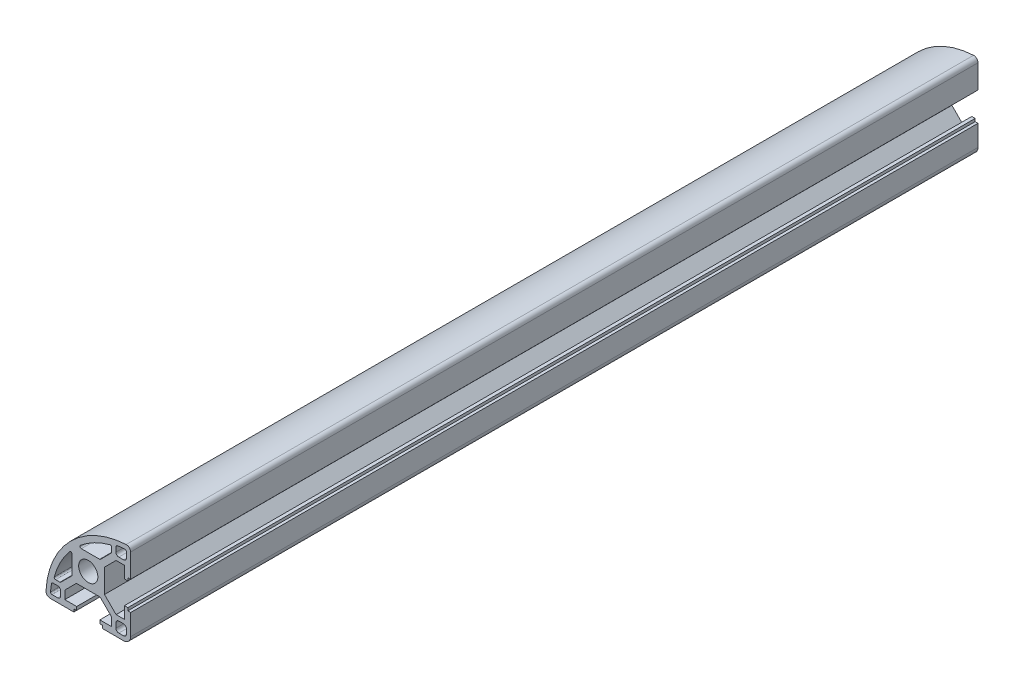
ISO-10303-21;
HEADER;
FILE_DESCRIPTION(('STEP AP214'),'2;1');
FILE_NAME('part.step','',(''),(''),'','','');
FILE_SCHEMA(('AUTOMOTIVE_DESIGN { 1 0 10303 214 1 1 1 1 }'));
ENDSEC;
DATA;
#1=APPLICATION_CONTEXT('core data for automotive mechanical design processes');
#2=APPLICATION_PROTOCOL_DEFINITION('international standard','automotive_design',2000,#1);
#3=PRODUCT_CONTEXT('',#1,'mechanical');
#4=PRODUCT('Part','Part','',(#3));
#5=PRODUCT_RELATED_PRODUCT_CATEGORY('part','',(#4));
#6=PRODUCT_DEFINITION_FORMATION('','',#4);
#7=PRODUCT_DEFINITION_CONTEXT('part definition',#1,'design');
#8=PRODUCT_DEFINITION('design','',#6,#7);
#9=PRODUCT_DEFINITION_SHAPE('','',#8);
#10=(LENGTH_UNIT() NAMED_UNIT(*) SI_UNIT(.MILLI.,.METRE.));
#11=(NAMED_UNIT(*) PLANE_ANGLE_UNIT() SI_UNIT($,.RADIAN.));
#12=(NAMED_UNIT(*) SI_UNIT($,.STERADIAN.) SOLID_ANGLE_UNIT());
#13=UNCERTAINTY_MEASURE_WITH_UNIT(LENGTH_MEASURE(1.E-05),#10,'distance_accuracy_value','');
#14=(GEOMETRIC_REPRESENTATION_CONTEXT(3) GLOBAL_UNCERTAINTY_ASSIGNED_CONTEXT((#13)) GLOBAL_UNIT_ASSIGNED_CONTEXT((#10,
#11,#12)) REPRESENTATION_CONTEXT('',''));
#15=CARTESIAN_POINT('',(0.,0.,0.));
#16=DIRECTION('',(0.,0.,1.));
#17=DIRECTION('',(1.,0.,0.));
#18=AXIS2_PLACEMENT_3D('',#15,#16,#17);
#19=CARTESIAN_POINT('',(12.4999999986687,-12.4999999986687,300.));
#20=DIRECTION('',(0.,0.,1.));
#21=DIRECTION('',(1.,0.,0.));
#22=AXIS2_PLACEMENT_3D('',#19,#20,#21);
#23=PLANE('',#22);
#24=CARTESIAN_POINT('',(-11.5407234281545,-7.79999999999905,300.));
#25=DIRECTION('',(0.,0.,1.));
#26=DIRECTION('',(1.,0.,0.));
#27=AXIS2_PLACEMENT_3D('',#24,#25,#26);
#28=CIRCLE('',#27,0.499999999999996);
#29=CARTESIAN_POINT('',(-12.0232820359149,-7.66909090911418,300.));
#30=VERTEX_POINT('',#29);
#31=CARTESIAN_POINT('',(-11.5407234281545,-8.29999999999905,300.));
#32=VERTEX_POINT('',#31);
#33=EDGE_CURVE('E563',#30,#32,#28,.T.);
#34=ORIENTED_EDGE('',*,*,#33,.F.);
#35=CARTESIAN_POINT('',(14.9999999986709,-14.9999999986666,300.));
#36=DIRECTION('',(0.,0.,1.));
#37=DIRECTION('',(1.,0.,0.));
#38=AXIS2_PLACEMENT_3D('',#35,#36,#37);
#39=CIRCLE('',#38,28.0000000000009);
#40=CARTESIAN_POINT('',(-6.63636363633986,2.77266914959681,300.));
#41=VERTEX_POINT('',#40);
#42=EDGE_CURVE('E561',#41,#30,#39,.T.);
#43=ORIENTED_EDGE('',*,*,#42,.F.);
#44=CARTESIAN_POINT('',(-6.25000000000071,2.45530005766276,300.));
#45=DIRECTION('',(0.,0.,1.));
#46=DIRECTION('',(1.,0.,0.));
#47=AXIS2_PLACEMENT_3D('',#44,#45,#46);
#48=CIRCLE('',#47,0.500000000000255);
#49=CARTESIAN_POINT('',(-5.75000000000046,2.45530005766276,300.));
#50=VERTEX_POINT('',#49);
#51=EDGE_CURVE('E577',#50,#41,#48,.T.);
#52=ORIENTED_EDGE('',*,*,#51,.F.);
#53=DIRECTION('',(0.,1.,0.));
#54=VECTOR('',#53,1.);
#55=CARTESIAN_POINT('',(-5.75000000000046,-3.98725829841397,300.));
#56=LINE('',#55,#54);
#57=CARTESIAN_POINT('',(-5.75000000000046,-3.98725829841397,300.));
#58=VERTEX_POINT('',#57);
#59=EDGE_CURVE('E574',#58,#50,#56,.T.);
#60=ORIENTED_EDGE('',*,*,#59,.F.);
#61=CARTESIAN_POINT('',(-6.25000000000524,-3.98725829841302,300.));
#62=DIRECTION('',(0.,0.,1.));
#63=DIRECTION('',(1.,0.,0.));
#64=AXIS2_PLACEMENT_3D('',#61,#62,#63);
#65=CIRCLE('',#64,0.500000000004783);
#66=CARTESIAN_POINT('',(-5.89644660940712,-4.34081168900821,300.));
#67=VERTEX_POINT('',#66);
#68=EDGE_CURVE('E572',#67,#58,#65,.T.);
#69=ORIENTED_EDGE('',*,*,#68,.F.);
#70=DIRECTION('',(0.707106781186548,0.707106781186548,0.));
#71=VECTOR('',#70,1.);
#72=CARTESIAN_POINT('',(-9.70918831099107,-8.15355339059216,300.));
#73=LINE('',#72,#71);
#74=CARTESIAN_POINT('',(-9.70918831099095,-8.15355339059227,300.));
#75=VERTEX_POINT('',#74);
#76=EDGE_CURVE('E570',#75,#67,#73,.T.);
#77=ORIENTED_EDGE('',*,*,#76,.F.);
#78=CARTESIAN_POINT('',(-10.0627417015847,-7.79999999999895,300.));
#79=DIRECTION('',(0.,0.,1.));
#80=DIRECTION('',(1.,0.,0.));
#81=AXIS2_PLACEMENT_3D('',#78,#79,#80);
#82=CIRCLE('',#81,0.500000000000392);
#83=CARTESIAN_POINT('',(-10.0627417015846,-8.29999999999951,300.));
#84=VERTEX_POINT('',#83);
#85=EDGE_CURVE('E568',#84,#75,#82,.T.);
#86=ORIENTED_EDGE('',*,*,#85,.F.);
#87=DIRECTION('',(1.,-3.07512293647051E-13,0.));
#88=VECTOR('',#87,1.);
#89=CARTESIAN_POINT('',(-11.5407234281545,-8.29999999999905,300.));
#90=LINE('',#89,#88);
#91=EDGE_CURVE('E566',#32,#84,#90,.T.);
#92=ORIENTED_EDGE('',*,*,#91,.F.);
#93=EDGE_LOOP('',(#34,#43,#52,#60,#69,#77,#86,#92));
#94=FACE_BOUND('',#93,.T.);
#95=CARTESIAN_POINT('',(14.9999999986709,-14.9999999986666,300.));
#96=DIRECTION('',(0.,0.,1.));
#97=DIRECTION('',(1.,0.,0.));
#98=AXIS2_PLACEMENT_3D('',#95,#96,#97);
#99=CIRCLE('',#98,28.0000000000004);
#100=CARTESIAN_POINT('',(7.66909090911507,12.0232820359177,300.));
#101=VERTEX_POINT('',#100);
#102=CARTESIAN_POINT('',(-2.77266914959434,6.63636363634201,300.));
#103=VERTEX_POINT('',#102);
#104=EDGE_CURVE('E682',#101,#103,#99,.T.);
#105=ORIENTED_EDGE('',*,*,#104,.F.);
#106=CARTESIAN_POINT('',(7.80000000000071,11.5407234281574,300.));
#107=DIRECTION('',(0.,0.,1.));
#108=DIRECTION('',(1.,0.,0.));
#109=AXIS2_PLACEMENT_3D('',#106,#107,#108);
#110=CIRCLE('',#109,0.500000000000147);
#111=CARTESIAN_POINT('',(8.30000000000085,11.5407234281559,300.));
#112=VERTEX_POINT('',#111);
#113=EDGE_CURVE('E680',#112,#101,#110,.T.);
#114=ORIENTED_EDGE('',*,*,#113,.F.);
#115=DIRECTION('',(0.,1.,0.));
#116=VECTOR('',#115,1.);
#117=CARTESIAN_POINT('',(8.30000000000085,10.0627417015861,300.));
#118=LINE('',#117,#116);
#119=CARTESIAN_POINT('',(8.30000000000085,10.0627417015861,300.));
#120=VERTEX_POINT('',#119);
#121=EDGE_CURVE('E696',#120,#112,#118,.T.);
#122=ORIENTED_EDGE('',*,*,#121,.F.);
#123=CARTESIAN_POINT('',(7.80000000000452,10.0627417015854,300.));
#124=DIRECTION('',(0.,0.,1.));
#125=DIRECTION('',(1.,0.,0.));
#126=AXIS2_PLACEMENT_3D('',#123,#124,#125);
#127=CIRCLE('',#126,0.499999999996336);
#128=CARTESIAN_POINT('',(8.15355339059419,9.70918831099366,300.));
#129=VERTEX_POINT('',#128);
#130=EDGE_CURVE('E693',#129,#120,#127,.T.);
#131=ORIENTED_EDGE('',*,*,#130,.F.);
#132=DIRECTION('',(0.707106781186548,0.707106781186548,0.));
#133=VECTOR('',#132,1.);
#134=CARTESIAN_POINT('',(4.34081168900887,5.89644660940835,300.));
#135=LINE('',#134,#133);
#136=CARTESIAN_POINT('',(4.34081168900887,5.89644660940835,300.));
#137=VERTEX_POINT('',#136);
#138=EDGE_CURVE('E691',#137,#129,#135,.T.);
#139=ORIENTED_EDGE('',*,*,#138,.F.);
#140=CARTESIAN_POINT('',(3.98725829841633,6.25000000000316,300.));
#141=DIRECTION('',(0.,0.,1.));
#142=DIRECTION('',(1.,0.,0.));
#143=AXIS2_PLACEMENT_3D('',#140,#141,#142);
#144=CIRCLE('',#143,0.50000000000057);
#145=CARTESIAN_POINT('',(3.98725829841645,5.7500000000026,300.));
#146=VERTEX_POINT('',#145);
#147=EDGE_CURVE('E689',#146,#137,#144,.T.);
#148=ORIENTED_EDGE('',*,*,#147,.F.);
#149=DIRECTION('',(1.,0.,0.));
#150=VECTOR('',#149,1.);
#151=CARTESIAN_POINT('',(-2.45530005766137,5.7500000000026,300.));
#152=LINE('',#151,#150);
#153=CARTESIAN_POINT('',(-2.45530005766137,5.7500000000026,300.));
#154=VERTEX_POINT('',#153);
#155=EDGE_CURVE('E687',#154,#146,#152,.T.);
#156=ORIENTED_EDGE('',*,*,#155,.F.);
#157=CARTESIAN_POINT('',(-2.4553000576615,6.25000000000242,300.));
#158=DIRECTION('',(0.,0.,1.));
#159=DIRECTION('',(1.,0.,0.));
#160=AXIS2_PLACEMENT_3D('',#157,#158,#159);
#161=CIRCLE('',#160,0.499999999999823);
#162=EDGE_CURVE('E685',#103,#154,#161,.T.);
#163=ORIENTED_EDGE('',*,*,#162,.F.);
#164=EDGE_LOOP('',(#105,#114,#122,#131,#139,#148,#156,#163));
#165=FACE_BOUND('',#164,.T.);
#166=CARTESIAN_POINT('',(0.,0.,300.));
#167=DIRECTION('',(0.,0.,1.));
#168=DIRECTION('',(1.,0.,0.));
#169=AXIS2_PLACEMENT_3D('',#166,#167,#168);
#170=CIRCLE('',#169,3.40000000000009);
#171=CARTESIAN_POINT('',(3.40000000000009,0.,300.));
#172=VERTEX_POINT('',#171);
#173=EDGE_CURVE('E799',#172,#172,#170,.T.);
#174=ORIENTED_EDGE('',*,*,#173,.F.);
#175=EDGE_LOOP('',(#174));
#176=FACE_BOUND('',#175,.T.);
#177=DIRECTION('',(0.,-1.,0.));
#178=VECTOR('',#177,1.);
#179=CARTESIAN_POINT('',(5.10000000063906,-13.999999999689,300.));
#180=LINE('',#179,#178);
#181=CARTESIAN_POINT('',(5.10000000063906,-13.999999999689,300.));
#182=VERTEX_POINT('',#181);
#183=CARTESIAN_POINT('',(5.10000000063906,-14.999999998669,300.));
#184=VERTEX_POINT('',#183);
#185=EDGE_CURVE('E805',#182,#184,#180,.T.);
#186=ORIENTED_EDGE('',*,*,#185,.T.);
#187=DIRECTION('',(1.,0.,0.));
#188=VECTOR('',#187,1.);
#189=CARTESIAN_POINT('',(5.10000000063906,-14.999999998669,300.));
#190=LINE('',#189,#188);
#191=CARTESIAN_POINT('',(12.4999999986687,-14.999999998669,300.));
#192=VERTEX_POINT('',#191);
#193=EDGE_CURVE('E808',#184,#192,#190,.T.);
#194=ORIENTED_EDGE('',*,*,#193,.T.);
#195=CARTESIAN_POINT('',(12.4999999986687,-12.4999999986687,300.));
#196=DIRECTION('',(0.,0.,1.));
#197=DIRECTION('',(1.,0.,0.));
#198=AXIS2_PLACEMENT_3D('',#195,#196,#197);
#199=CIRCLE('',#198,2.50000000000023);
#200=CARTESIAN_POINT('',(14.999999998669,-12.4999999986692,300.));
#201=VERTEX_POINT('',#200);
#202=EDGE_CURVE('E811',#192,#201,#199,.T.);
#203=ORIENTED_EDGE('',*,*,#202,.T.);
#204=DIRECTION('',(0.,1.,0.));
#205=VECTOR('',#204,1.);
#206=CARTESIAN_POINT('',(14.999999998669,-12.4999999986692,300.));
#207=LINE('',#206,#205);
#208=CARTESIAN_POINT('',(14.999999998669,-5.10000000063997,300.));
#209=VERTEX_POINT('',#208);
#210=EDGE_CURVE('E813',#201,#209,#207,.T.);
#211=ORIENTED_EDGE('',*,*,#210,.T.);
#212=DIRECTION('',(-1.,0.,0.));
#213=VECTOR('',#212,1.);
#214=CARTESIAN_POINT('',(14.999999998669,-5.10000000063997,300.));
#215=LINE('',#214,#213);
#216=CARTESIAN_POINT('',(13.9999999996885,-5.10000000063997,300.));
#217=VERTEX_POINT('',#216);
#218=EDGE_CURVE('E815',#209,#217,#215,.T.);
#219=ORIENTED_EDGE('',*,*,#218,.T.);
#220=DIRECTION('',(0.,1.,0.));
#221=VECTOR('',#220,1.);
#222=CARTESIAN_POINT('',(13.9999999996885,-5.10000000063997,300.));
#223=LINE('',#222,#221);
#224=CARTESIAN_POINT('',(13.9999999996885,-4.0999999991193,300.));
#225=VERTEX_POINT('',#224);
#226=EDGE_CURVE('E817',#217,#225,#223,.T.);
#227=ORIENTED_EDGE('',*,*,#226,.T.);
#228=DIRECTION('',(-1.,0.,0.));
#229=VECTOR('',#228,1.);
#230=CARTESIAN_POINT('',(13.9999999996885,-4.0999999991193,300.));
#231=LINE('',#230,#229);
#232=CARTESIAN_POINT('',(12.7999999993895,-4.0999999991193,300.));
#233=VERTEX_POINT('',#232);
#234=EDGE_CURVE('E819',#225,#233,#231,.T.);
#235=ORIENTED_EDGE('',*,*,#234,.T.);
#236=DIRECTION('',(0.,-1.,0.));
#237=VECTOR('',#236,1.);
#238=CARTESIAN_POINT('',(12.7999999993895,-4.0999999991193,300.));
#239=LINE('',#238,#237);
#240=CARTESIAN_POINT('',(12.7999999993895,-8.29999999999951,300.));
#241=VERTEX_POINT('',#240);
#242=EDGE_CURVE('E821',#233,#241,#239,.T.);
#243=ORIENTED_EDGE('',*,*,#242,.T.);
#244=DIRECTION('',(-1.,0.,0.));
#245=VECTOR('',#244,1.);
#246=CARTESIAN_POINT('',(12.7999999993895,-8.29999999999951,300.));
#247=LINE('',#246,#245);
#248=CARTESIAN_POINT('',(9.85563492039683,-8.29999999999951,300.));
#249=VERTEX_POINT('',#248);
#250=EDGE_CURVE('E823',#241,#249,#247,.T.);
#251=ORIENTED_EDGE('',*,*,#250,.T.);
#252=DIRECTION('',(-0.707106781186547,0.707106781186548,0.));
#253=VECTOR('',#252,1.);
#254=CARTESIAN_POINT('',(9.85563492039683,-8.29999999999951,300.));
#255=LINE('',#254,#253);
#256=CARTESIAN_POINT('',(5.74999999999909,-4.19436507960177,300.));
#257=VERTEX_POINT('',#256);
#258=EDGE_CURVE('E825',#249,#257,#255,.T.);
#259=ORIENTED_EDGE('',*,*,#258,.T.);
#260=DIRECTION('',(0.,1.,0.));
#261=VECTOR('',#260,1.);
#262=CARTESIAN_POINT('',(5.74999999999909,-4.19436507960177,300.));
#263=LINE('',#262,#261);
#264=CARTESIAN_POINT('',(5.74999999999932,4.19436507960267,300.));
#265=VERTEX_POINT('',#264);
#266=EDGE_CURVE('E827',#257,#265,#263,.T.);
#267=ORIENTED_EDGE('',*,*,#266,.T.);
#268=DIRECTION('',(0.707106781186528,0.707106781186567,0.));
#269=VECTOR('',#268,1.);
#270=CARTESIAN_POINT('',(5.74999999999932,4.19436507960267,300.));
#271=LINE('',#270,#269);
#272=CARTESIAN_POINT('',(9.85563492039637,8.29999999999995,300.));
#273=VERTEX_POINT('',#272);
#274=EDGE_CURVE('E829',#265,#273,#271,.T.);
#275=ORIENTED_EDGE('',*,*,#274,.T.);
#276=DIRECTION('',(1.,1.15476780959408E-13,0.));
#277=VECTOR('',#276,1.);
#278=CARTESIAN_POINT('',(9.85563492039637,8.29999999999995,300.));
#279=LINE('',#278,#277);
#280=CARTESIAN_POINT('',(12.7999999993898,8.30000000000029,300.));
#281=VERTEX_POINT('',#280);
#282=EDGE_CURVE('E831',#273,#281,#279,.T.);
#283=ORIENTED_EDGE('',*,*,#282,.T.);
#284=DIRECTION('',(0.,-1.,0.));
#285=VECTOR('',#284,1.);
#286=CARTESIAN_POINT('',(12.7999999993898,8.30000000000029,300.));
#287=LINE('',#286,#285);
#288=CARTESIAN_POINT('',(12.7999999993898,4.09999999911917,300.));
#289=VERTEX_POINT('',#288);
#290=EDGE_CURVE('E833',#281,#289,#287,.T.);
#291=ORIENTED_EDGE('',*,*,#290,.T.);
#292=DIRECTION('',(1.,0.,0.));
#293=VECTOR('',#292,1.);
#294=CARTESIAN_POINT('',(12.7999999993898,4.09999999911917,300.));
#295=LINE('',#294,#293);
#296=CARTESIAN_POINT('',(13.9999999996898,4.09999999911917,300.));
#297=VERTEX_POINT('',#296);
#298=EDGE_CURVE('E835',#289,#297,#295,.T.);
#299=ORIENTED_EDGE('',*,*,#298,.T.);
#300=DIRECTION('',(0.,1.,0.));
#301=VECTOR('',#300,1.);
#302=CARTESIAN_POINT('',(13.9999999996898,4.09999999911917,300.));
#303=LINE('',#302,#301);
#304=CARTESIAN_POINT('',(13.9999999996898,5.10000000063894,300.));
#305=VERTEX_POINT('',#304);
#306=EDGE_CURVE('E837',#297,#305,#303,.T.);
#307=ORIENTED_EDGE('',*,*,#306,.T.);
#308=DIRECTION('',(1.,0.,0.));
#309=VECTOR('',#308,1.);
#310=CARTESIAN_POINT('',(13.9999999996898,5.10000000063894,300.));
#311=LINE('',#310,#309);
#312=CARTESIAN_POINT('',(14.9999999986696,5.10000000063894,300.));
#313=VERTEX_POINT('',#312);
#314=EDGE_CURVE('E839',#305,#313,#311,.T.);
#315=ORIENTED_EDGE('',*,*,#314,.T.);
#316=DIRECTION('',(0.,1.,0.));
#317=VECTOR('',#316,1.);
#318=CARTESIAN_POINT('',(14.9999999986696,5.10000000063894,300.));
#319=LINE('',#318,#317);
#320=CARTESIAN_POINT('',(14.9999999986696,13.4604989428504,300.));
#321=VERTEX_POINT('',#320);
#322=EDGE_CURVE('E841',#313,#321,#319,.T.);
#323=ORIENTED_EDGE('',*,*,#322,.T.);
#324=CARTESIAN_POINT('',(13.4999999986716,13.4604989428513,300.));
#325=DIRECTION('',(0.,0.,1.));
#326=DIRECTION('',(1.,0.,0.));
#327=AXIS2_PLACEMENT_3D('',#324,#325,#326);
#328=CIRCLE('',#327,1.49999999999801);
#329=CARTESIAN_POINT('',(13.4210526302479,14.958419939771,300.));
#330=VERTEX_POINT('',#329);
#331=EDGE_CURVE('E843',#321,#330,#328,.T.);
#332=ORIENTED_EDGE('',*,*,#331,.T.);
#333=CARTESIAN_POINT('',(14.9999999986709,-14.9999999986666,300.));
#334=DIRECTION('',(0.,0.,1.));
#335=DIRECTION('',(1.,0.,0.));
#336=AXIS2_PLACEMENT_3D('',#333,#334,#335);
#337=CIRCLE('',#336,30.0000000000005);
#338=CARTESIAN_POINT('',(-14.9584199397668,-13.4210526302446,300.));
#339=VERTEX_POINT('',#338);
#340=EDGE_CURVE('E845',#330,#339,#337,.T.);
#341=ORIENTED_EDGE('',*,*,#340,.T.);
#342=CARTESIAN_POINT('',(-13.4604989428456,-13.4999999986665,300.));
#343=DIRECTION('',(0.,0.,1.));
#344=DIRECTION('',(1.,0.,0.));
#345=AXIS2_PLACEMENT_3D('',#342,#343,#344);
#346=CIRCLE('',#345,1.49999999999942);
#347=CARTESIAN_POINT('',(-13.4604989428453,-14.9999999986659,300.));
#348=VERTEX_POINT('',#347);
#349=EDGE_CURVE('E847',#339,#348,#346,.T.);
#350=ORIENTED_EDGE('',*,*,#349,.T.);
#351=DIRECTION('',(1.,0.,0.));
#352=VECTOR('',#351,1.);
#353=CARTESIAN_POINT('',(-13.4604989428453,-14.9999999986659,300.));
#354=LINE('',#353,#352);
#355=CARTESIAN_POINT('',(-5.10000000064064,-14.9999999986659,300.));
#356=VERTEX_POINT('',#355);
#357=EDGE_CURVE('E849',#348,#356,#354,.T.);
#358=ORIENTED_EDGE('',*,*,#357,.T.);
#359=DIRECTION('',(0.,1.,0.));
#360=VECTOR('',#359,1.);
#361=CARTESIAN_POINT('',(-5.10000000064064,-14.9999999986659,300.));
#362=LINE('',#361,#360);
#363=CARTESIAN_POINT('',(-5.10000000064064,-13.9999999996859,300.));
#364=VERTEX_POINT('',#363);
#365=EDGE_CURVE('E851',#356,#364,#362,.T.);
#366=ORIENTED_EDGE('',*,*,#365,.T.);
#367=DIRECTION('',(1.,0.,0.));
#368=VECTOR('',#367,1.);
#369=CARTESIAN_POINT('',(-5.10000000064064,-13.9999999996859,300.));
#370=LINE('',#369,#368);
#371=CARTESIAN_POINT('',(-4.09999999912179,-13.9999999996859,300.));
#372=VERTEX_POINT('',#371);
#373=EDGE_CURVE('E853',#364,#372,#370,.T.);
#374=ORIENTED_EDGE('',*,*,#373,.T.);
#375=DIRECTION('',(0.,1.,0.));
#376=VECTOR('',#375,1.);
#377=CARTESIAN_POINT('',(-4.09999999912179,-13.9999999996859,300.));
#378=LINE('',#377,#376);
#379=CARTESIAN_POINT('',(-4.09999999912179,-12.7999999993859,300.));
#380=VERTEX_POINT('',#379);
#381=EDGE_CURVE('E855',#372,#380,#378,.T.);
#382=ORIENTED_EDGE('',*,*,#381,.T.);
#383=DIRECTION('',(-1.,0.,0.));
#384=VECTOR('',#383,1.);
#385=CARTESIAN_POINT('',(-4.09999999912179,-12.7999999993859,300.));
#386=LINE('',#385,#384);
#387=CARTESIAN_POINT('',(-8.30000000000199,-12.7999999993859,300.));
#388=VERTEX_POINT('',#387);
#389=EDGE_CURVE('E857',#380,#388,#386,.T.);
#390=ORIENTED_EDGE('',*,*,#389,.T.);
#391=DIRECTION('',(0.,1.,0.));
#392=VECTOR('',#391,1.);
#393=CARTESIAN_POINT('',(-8.30000000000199,-12.7999999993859,300.));
#394=LINE('',#393,#392);
#395=CARTESIAN_POINT('',(-8.30000000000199,-9.85563492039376,300.));
#396=VERTEX_POINT('',#395);
#397=EDGE_CURVE('E859',#388,#396,#394,.T.);
#398=ORIENTED_EDGE('',*,*,#397,.T.);
#399=DIRECTION('',(0.707106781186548,0.707106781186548,0.));
#400=VECTOR('',#399,1.);
#401=CARTESIAN_POINT('',(-8.30000000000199,-9.85563492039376,300.));
#402=LINE('',#401,#400);
#403=CARTESIAN_POINT('',(-4.19436507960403,-5.7499999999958,300.));
#404=VERTEX_POINT('',#403);
#405=EDGE_CURVE('E861',#396,#404,#402,.T.);
#406=ORIENTED_EDGE('',*,*,#405,.T.);
#407=DIRECTION('',(1.,0.,0.));
#408=VECTOR('',#407,1.);
#409=CARTESIAN_POINT('',(-4.19436507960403,-5.7499999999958,300.));
#410=LINE('',#409,#408);
#411=CARTESIAN_POINT('',(4.19436507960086,-5.7499999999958,300.));
#412=VERTEX_POINT('',#411);
#413=EDGE_CURVE('E863',#404,#412,#410,.T.);
#414=ORIENTED_EDGE('',*,*,#413,.T.);
#415=DIRECTION('',(0.707106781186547,-0.707106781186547,0.));
#416=VECTOR('',#415,1.);
#417=CARTESIAN_POINT('',(4.19436507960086,-5.7499999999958,300.));
#418=LINE('',#417,#416);
#419=CARTESIAN_POINT('',(8.29999999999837,-9.85563492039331,300.));
#420=VERTEX_POINT('',#419);
#421=EDGE_CURVE('E865',#412,#420,#418,.T.);
#422=ORIENTED_EDGE('',*,*,#421,.T.);
#423=DIRECTION('',(0.,-1.,0.));
#424=VECTOR('',#423,1.);
#425=CARTESIAN_POINT('',(8.29999999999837,-9.85563492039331,300.));
#426=LINE('',#425,#424);
#427=CARTESIAN_POINT('',(8.29999999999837,-12.7999999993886,300.));
#428=VERTEX_POINT('',#427);
#429=EDGE_CURVE('E867',#420,#428,#426,.T.);
#430=ORIENTED_EDGE('',*,*,#429,.T.);
#431=DIRECTION('',(-1.,0.,0.));
#432=VECTOR('',#431,1.);
#433=CARTESIAN_POINT('',(8.29999999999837,-12.7999999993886,300.));
#434=LINE('',#433,#432);
#435=CARTESIAN_POINT('',(4.09999999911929,-12.7999999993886,300.));
#436=VERTEX_POINT('',#435);
#437=EDGE_CURVE('E869',#428,#436,#434,.T.);
#438=ORIENTED_EDGE('',*,*,#437,.T.);
#439=DIRECTION('',(0.,-1.,0.));
#440=VECTOR('',#439,1.);
#441=CARTESIAN_POINT('',(4.09999999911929,-12.7999999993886,300.));
#442=LINE('',#441,#440);
#443=CARTESIAN_POINT('',(4.09999999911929,-13.999999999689,300.));
#444=VERTEX_POINT('',#443);
#445=EDGE_CURVE('E871',#436,#444,#442,.T.);
#446=ORIENTED_EDGE('',*,*,#445,.T.);
#447=DIRECTION('',(1.,0.,0.));
#448=VECTOR('',#447,1.);
#449=CARTESIAN_POINT('',(4.09999999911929,-13.999999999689,300.));
#450=LINE('',#449,#448);
#451=EDGE_CURVE('E873',#444,#182,#450,.T.);
#452=ORIENTED_EDGE('',*,*,#451,.T.);
#453=EDGE_LOOP('',(#186,#194,#203,#211,#219,#227,#235,#243,#251,#259,#267,#275,#283,#291,#299,
#307,#315,#323,#332,#341,#350,#358,#366,#374,#382,#390,#398,#406,#414,#422,#430,#438,#446,#452));
#454=FACE_BOUND('',#453,.T.);
#455=DIRECTION('',(0.,-1.,0.));
#456=VECTOR('',#455,1.);
#457=CARTESIAN_POINT('',(9.7999999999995,-10.7999999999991,300.));
#458=LINE('',#457,#456);
#459=CARTESIAN_POINT('',(9.7999999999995,-10.7999999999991,300.));
#460=VERTEX_POINT('',#459);
#461=CARTESIAN_POINT('',(9.7999999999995,-12.4999999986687,300.));
#462=VERTEX_POINT('',#461);
#463=EDGE_CURVE('E742',#460,#462,#458,.T.);
#464=ORIENTED_EDGE('',*,*,#463,.F.);
#465=CARTESIAN_POINT('',(10.7999999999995,-10.7999999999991,300.));
#466=DIRECTION('',(0.,0.,1.));
#467=DIRECTION('',(1.,0.,0.));
#468=AXIS2_PLACEMENT_3D('',#465,#466,#467);
#469=CIRCLE('',#468,1.);
#470=CARTESIAN_POINT('',(10.7999999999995,-9.79999999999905,300.));
#471=VERTEX_POINT('',#470);
#472=EDGE_CURVE('E740',#471,#460,#469,.T.);
#473=ORIENTED_EDGE('',*,*,#472,.F.);
#474=DIRECTION('',(-1.,0.,0.));
#475=VECTOR('',#474,1.);
#476=CARTESIAN_POINT('',(12.4999999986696,-9.79999999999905,300.));
#477=LINE('',#476,#475);
#478=CARTESIAN_POINT('',(12.4999999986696,-9.79999999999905,300.));
#479=VERTEX_POINT('',#478);
#480=EDGE_CURVE('E756',#479,#471,#477,.T.);
#481=ORIENTED_EDGE('',*,*,#480,.F.);
#482=CARTESIAN_POINT('',(12.4999999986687,-10.799999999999,300.));
#483=DIRECTION('',(0.,0.,1.));
#484=DIRECTION('',(1.,0.,0.));
#485=AXIS2_PLACEMENT_3D('',#482,#483,#484);
#486=CIRCLE('',#485,0.999999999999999);
#487=CARTESIAN_POINT('',(13.4999999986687,-10.7999999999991,300.));
#488=VERTEX_POINT('',#487);
#489=EDGE_CURVE('E753',#488,#479,#486,.T.);
#490=ORIENTED_EDGE('',*,*,#489,.F.);
#491=DIRECTION('',(0.,1.,0.));
#492=VECTOR('',#491,1.);
#493=CARTESIAN_POINT('',(13.4999999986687,-12.4999999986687,300.));
#494=LINE('',#493,#492);
#495=CARTESIAN_POINT('',(13.4999999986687,-12.4999999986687,300.));
#496=VERTEX_POINT('',#495);
#497=EDGE_CURVE('E751',#496,#488,#494,.T.);
#498=ORIENTED_EDGE('',*,*,#497,.F.);
#499=CARTESIAN_POINT('',(12.4999999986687,-12.4999999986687,300.));
#500=DIRECTION('',(0.,0.,1.));
#501=DIRECTION('',(1.,0.,0.));
#502=AXIS2_PLACEMENT_3D('',#499,#500,#501);
#503=CIRCLE('',#502,1.);
#504=CARTESIAN_POINT('',(12.4999999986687,-13.4999999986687,300.));
#505=VERTEX_POINT('',#504);
#506=EDGE_CURVE('E749',#505,#496,#503,.T.);
#507=ORIENTED_EDGE('',*,*,#506,.F.);
#508=DIRECTION('',(1.,0.,0.));
#509=VECTOR('',#508,1.);
#510=CARTESIAN_POINT('',(10.7999999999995,-13.4999999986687,300.));
#511=LINE('',#510,#509);
#512=CARTESIAN_POINT('',(10.7999999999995,-13.4999999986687,300.));
#513=VERTEX_POINT('',#512);
#514=EDGE_CURVE('E747',#513,#505,#511,.T.);
#515=ORIENTED_EDGE('',*,*,#514,.F.);
#516=CARTESIAN_POINT('',(10.7999999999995,-12.4999999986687,300.));
#517=DIRECTION('',(0.,0.,1.));
#518=DIRECTION('',(1.,0.,0.));
#519=AXIS2_PLACEMENT_3D('',#516,#517,#518);
#520=CIRCLE('',#519,1.);
#521=EDGE_CURVE('E745',#462,#513,#520,.T.);
#522=ORIENTED_EDGE('',*,*,#521,.F.);
#523=EDGE_LOOP('',(#464,#473,#481,#490,#498,#507,#515,#522));
#524=FACE_BOUND('',#523,.T.);
#525=CARTESIAN_POINT('',(14.9999999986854,-14.5817447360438,300.));
#526=DIRECTION('',(0.,0.,1.));
#527=DIRECTION('',(1.,0.,0.));
#528=AXIS2_PLACEMENT_3D('',#525,#526,#527);
#529=CIRCLE('',#528,28.0000000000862);
#530=CARTESIAN_POINT('',(12.9636363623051,13.3441075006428,300.));
#531=VERTEX_POINT('',#530);
#532=CARTESIAN_POINT('',(10.2145454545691,13.0062857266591,300.));
#533=VERTEX_POINT('',#532);
#534=EDGE_CURVE('E623',#531,#533,#529,.T.);
#535=ORIENTED_EDGE('',*,*,#534,.F.);
#536=CARTESIAN_POINT('',(12.9999999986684,12.845431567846,300.));
#537=DIRECTION('',(0.,0.,1.));
#538=DIRECTION('',(1.,0.,0.));
#539=AXIS2_PLACEMENT_3D('',#536,#537,#538);
#540=CIRCLE('',#539,0.500000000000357);
#541=CARTESIAN_POINT('',(13.4999999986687,12.8454315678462,300.));
#542=VERTEX_POINT('',#541);
#543=EDGE_CURVE('E621',#542,#531,#540,.T.);
#544=ORIENTED_EDGE('',*,*,#543,.F.);
#545=DIRECTION('',(0.,1.,0.));
#546=VECTOR('',#545,1.);
#547=CARTESIAN_POINT('',(13.4999999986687,10.8000000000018,300.));
#548=LINE('',#547,#546);
#549=CARTESIAN_POINT('',(13.4999999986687,10.8000000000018,300.));
#550=VERTEX_POINT('',#549);
#551=EDGE_CURVE('E637',#550,#542,#548,.T.);
#552=ORIENTED_EDGE('',*,*,#551,.F.);
#553=CARTESIAN_POINT('',(12.4999999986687,10.8000000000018,300.));
#554=DIRECTION('',(0.,0.,1.));
#555=DIRECTION('',(1.,0.,0.));
#556=AXIS2_PLACEMENT_3D('',#553,#554,#555);
#557=CIRCLE('',#556,0.999999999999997);
#558=CARTESIAN_POINT('',(12.4999999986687,9.80000000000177,300.));
#559=VERTEX_POINT('',#558);
#560=EDGE_CURVE('E634',#559,#550,#557,.T.);
#561=ORIENTED_EDGE('',*,*,#560,.F.);
#562=DIRECTION('',(1.,0.,0.));
#563=VECTOR('',#562,1.);
#564=CARTESIAN_POINT('',(10.7999999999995,9.80000000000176,300.));
#565=LINE('',#564,#563);
#566=CARTESIAN_POINT('',(10.7999999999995,9.80000000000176,300.));
#567=VERTEX_POINT('',#566);
#568=EDGE_CURVE('E632',#567,#559,#565,.T.);
#569=ORIENTED_EDGE('',*,*,#568,.F.);
#570=CARTESIAN_POINT('',(10.7999999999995,10.8000000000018,300.));
#571=DIRECTION('',(0.,0.,1.));
#572=DIRECTION('',(1.,0.,0.));
#573=AXIS2_PLACEMENT_3D('',#570,#571,#572);
#574=CIRCLE('',#573,1.00000000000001);
#575=CARTESIAN_POINT('',(9.7999999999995,10.8000000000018,300.));
#576=VERTEX_POINT('',#575);
#577=EDGE_CURVE('E630',#576,#567,#574,.T.);
#578=ORIENTED_EDGE('',*,*,#577,.F.);
#579=DIRECTION('',(0.,-1.,0.));
#580=VECTOR('',#579,1.);
#581=CARTESIAN_POINT('',(9.7999999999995,12.5136423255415,300.));
#582=LINE('',#581,#580);
#583=CARTESIAN_POINT('',(9.7999999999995,12.5136423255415,300.));
#584=VERTEX_POINT('',#583);
#585=EDGE_CURVE('E628',#584,#576,#582,.T.);
#586=ORIENTED_EDGE('',*,*,#585,.F.);
#587=CARTESIAN_POINT('',(10.2999999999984,12.5136423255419,300.));
#588=DIRECTION('',(0.,0.,1.));
#589=DIRECTION('',(1.,0.,0.));
#590=AXIS2_PLACEMENT_3D('',#587,#588,#589);
#591=CIRCLE('',#590,0.499999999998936);
#592=EDGE_CURVE('E626',#533,#584,#591,.T.);
#593=ORIENTED_EDGE('',*,*,#592,.F.);
#594=EDGE_LOOP('',(#535,#544,#552,#561,#569,#578,#586,#593));
#595=FACE_BOUND('',#594,.T.);
#596=CARTESIAN_POINT('',(-12.845431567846,-12.9999999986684,300.));
#597=DIRECTION('',(0.,0.,1.));
#598=DIRECTION('',(1.,0.,0.));
#599=AXIS2_PLACEMENT_3D('',#596,#597,#598);
#600=CIRCLE('',#599,0.500000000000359);
#601=CARTESIAN_POINT('',(-13.3441075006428,-12.9636363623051,300.));
#602=VERTEX_POINT('',#601);
#603=CARTESIAN_POINT('',(-12.8454315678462,-13.4999999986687,300.));
#604=VERTEX_POINT('',#603);
#605=EDGE_CURVE('E504',#602,#604,#600,.T.);
#606=ORIENTED_EDGE('',*,*,#605,.F.);
#607=CARTESIAN_POINT('',(14.5817447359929,-14.9999999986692,300.));
#608=DIRECTION('',(0.,0.,1.));
#609=DIRECTION('',(1.,0.,0.));
#610=AXIS2_PLACEMENT_3D('',#607,#608,#609);
#611=CIRCLE('',#610,28.0000000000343);
#612=CARTESIAN_POINT('',(-13.0062857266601,-10.2145454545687,300.));
#613=VERTEX_POINT('',#612);
#614=EDGE_CURVE('E496',#613,#602,#611,.T.);
#615=ORIENTED_EDGE('',*,*,#614,.F.);
#616=CARTESIAN_POINT('',(-12.5136423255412,-10.2999999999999,300.));
#617=DIRECTION('',(0.,0.,1.));
#618=DIRECTION('',(1.,0.,0.));
#619=AXIS2_PLACEMENT_3D('',#616,#617,#618);
#620=CIRCLE('',#619,0.500000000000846);
#621=CARTESIAN_POINT('',(-12.5136423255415,-9.79999999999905,300.));
#622=VERTEX_POINT('',#621);
#623=EDGE_CURVE('E529',#622,#613,#620,.T.);
#624=ORIENTED_EDGE('',*,*,#623,.F.);
#625=DIRECTION('',(-1.,0.,0.));
#626=VECTOR('',#625,1.);
#627=CARTESIAN_POINT('',(-10.8000000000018,-9.79999999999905,300.));
#628=LINE('',#627,#626);
#629=CARTESIAN_POINT('',(-10.8000000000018,-9.79999999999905,300.));
#630=VERTEX_POINT('',#629);
#631=EDGE_CURVE('E527',#630,#622,#628,.T.);
#632=ORIENTED_EDGE('',*,*,#631,.F.);
#633=CARTESIAN_POINT('',(-10.8000000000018,-10.7999999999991,300.));
#634=DIRECTION('',(0.,0.,1.));
#635=DIRECTION('',(1.,0.,0.));
#636=AXIS2_PLACEMENT_3D('',#633,#634,#635);
#637=CIRCLE('',#636,1.);
#638=CARTESIAN_POINT('',(-9.80000000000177,-10.7999999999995,300.));
#639=VERTEX_POINT('',#638);
#640=EDGE_CURVE('E525',#639,#630,#637,.T.);
#641=ORIENTED_EDGE('',*,*,#640,.F.);
#642=DIRECTION('',(0.,1.,0.));
#643=VECTOR('',#642,1.);
#644=CARTESIAN_POINT('',(-9.80000000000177,-12.4999999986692,300.));
#645=LINE('',#644,#643);
#646=CARTESIAN_POINT('',(-9.80000000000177,-12.4999999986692,300.));
#647=VERTEX_POINT('',#646);
#648=EDGE_CURVE('E523',#647,#639,#645,.T.);
#649=ORIENTED_EDGE('',*,*,#648,.F.);
#650=CARTESIAN_POINT('',(-10.8000000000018,-12.4999999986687,300.));
#651=DIRECTION('',(0.,0.,1.));
#652=DIRECTION('',(1.,0.,0.));
#653=AXIS2_PLACEMENT_3D('',#650,#651,#652);
#654=CIRCLE('',#653,1.);
#655=CARTESIAN_POINT('',(-10.8000000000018,-13.4999999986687,300.));
#656=VERTEX_POINT('',#655);
#657=EDGE_CURVE('E519',#656,#647,#654,.T.);
#658=ORIENTED_EDGE('',*,*,#657,.F.);
#659=DIRECTION('',(1.,0.,0.));
#660=VECTOR('',#659,1.);
#661=CARTESIAN_POINT('',(-12.8454315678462,-13.4999999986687,300.));
#662=LINE('',#661,#660);
#663=EDGE_CURVE('E517',#604,#656,#662,.T.);
#664=ORIENTED_EDGE('',*,*,#663,.F.);
#665=EDGE_LOOP('',(#606,#615,#624,#632,#641,#649,#658,#664));
#666=FACE_BOUND('',#665,.T.);
#667=ADVANCED_FACE('F35',(#94,#165,#176,#454,#524,#595,#666),#23,.T.);
#668=CARTESIAN_POINT('',(12.4999999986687,-12.4999999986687,0.));
#669=DIRECTION('',(0.,0.,1.));
#670=DIRECTION('',(1.,0.,0.));
#671=AXIS2_PLACEMENT_3D('',#668,#669,#670);
#672=PLANE('',#671);
#673=CARTESIAN_POINT('',(14.9999999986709,-14.9999999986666,0.));
#674=DIRECTION('',(0.,0.,1.));
#675=DIRECTION('',(1.,0.,0.));
#676=AXIS2_PLACEMENT_3D('',#673,#674,#675);
#677=CIRCLE('',#676,28.0000000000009);
#678=CARTESIAN_POINT('',(-6.63636363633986,2.77266914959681,0.));
#679=VERTEX_POINT('',#678);
#680=CARTESIAN_POINT('',(-12.0232820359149,-7.66909090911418,0.));
#681=VERTEX_POINT('',#680);
#682=EDGE_CURVE('E512',#679,#681,#677,.T.);
#683=ORIENTED_EDGE('',*,*,#682,.T.);
#684=CARTESIAN_POINT('',(-11.5407234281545,-7.79999999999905,0.));
#685=DIRECTION('',(0.,0.,1.));
#686=DIRECTION('',(1.,0.,0.));
#687=AXIS2_PLACEMENT_3D('',#684,#685,#686);
#688=CIRCLE('',#687,0.499999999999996);
#689=CARTESIAN_POINT('',(-11.5407234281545,-8.29999999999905,0.));
#690=VERTEX_POINT('',#689);
#691=EDGE_CURVE('E582',#681,#690,#688,.T.);
#692=ORIENTED_EDGE('',*,*,#691,.T.);
#693=DIRECTION('',(1.,-3.07512293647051E-13,0.));
#694=VECTOR('',#693,1.);
#695=CARTESIAN_POINT('',(-11.5407234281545,-8.29999999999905,0.));
#696=LINE('',#695,#694);
#697=CARTESIAN_POINT('',(-10.0627417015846,-8.29999999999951,0.));
#698=VERTEX_POINT('',#697);
#699=EDGE_CURVE('E585',#690,#698,#696,.T.);
#700=ORIENTED_EDGE('',*,*,#699,.T.);
#701=CARTESIAN_POINT('',(-10.0627417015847,-7.79999999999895,0.));
#702=DIRECTION('',(0.,0.,1.));
#703=DIRECTION('',(1.,0.,0.));
#704=AXIS2_PLACEMENT_3D('',#701,#702,#703);
#705=CIRCLE('',#704,0.500000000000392);
#706=CARTESIAN_POINT('',(-9.70918831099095,-8.15355339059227,0.));
#707=VERTEX_POINT('',#706);
#708=EDGE_CURVE('E588',#698,#707,#705,.T.);
#709=ORIENTED_EDGE('',*,*,#708,.T.);
#710=DIRECTION('',(0.707106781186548,0.707106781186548,0.));
#711=VECTOR('',#710,1.);
#712=CARTESIAN_POINT('',(-9.70918831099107,-8.15355339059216,0.));
#713=LINE('',#712,#711);
#714=CARTESIAN_POINT('',(-5.89644660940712,-4.34081168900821,0.));
#715=VERTEX_POINT('',#714);
#716=EDGE_CURVE('E591',#707,#715,#713,.T.);
#717=ORIENTED_EDGE('',*,*,#716,.T.);
#718=CARTESIAN_POINT('',(-6.25000000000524,-3.98725829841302,0.));
#719=DIRECTION('',(0.,0.,1.));
#720=DIRECTION('',(1.,0.,0.));
#721=AXIS2_PLACEMENT_3D('',#718,#719,#720);
#722=CIRCLE('',#721,0.500000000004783);
#723=CARTESIAN_POINT('',(-5.75000000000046,-3.98725829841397,0.));
#724=VERTEX_POINT('',#723);
#725=EDGE_CURVE('E594',#715,#724,#722,.T.);
#726=ORIENTED_EDGE('',*,*,#725,.T.);
#727=DIRECTION('',(0.,1.,0.));
#728=VECTOR('',#727,1.);
#729=CARTESIAN_POINT('',(-5.75000000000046,1.35828848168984E-12,0.));
#730=LINE('',#729,#728);
#731=CARTESIAN_POINT('',(-5.75000000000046,2.45530005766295,0.));
#732=VERTEX_POINT('',#731);
#733=EDGE_CURVE('E597',#724,#732,#730,.T.);
#734=ORIENTED_EDGE('',*,*,#733,.T.);
#735=CARTESIAN_POINT('',(-6.25000000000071,2.45530005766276,0.));
#736=DIRECTION('',(0.,0.,1.));
#737=DIRECTION('',(1.,0.,0.));
#738=AXIS2_PLACEMENT_3D('',#735,#736,#737);
#739=CIRCLE('',#738,0.500000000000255);
#740=EDGE_CURVE('E564',#732,#679,#739,.T.);
#741=ORIENTED_EDGE('',*,*,#740,.T.);
#742=EDGE_LOOP('',(#683,#692,#700,#709,#717,#726,#734,#741));
#743=FACE_BOUND('',#742,.T.);
#744=CARTESIAN_POINT('',(7.80000000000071,11.5407234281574,0.));
#745=DIRECTION('',(0.,0.,1.));
#746=DIRECTION('',(1.,0.,0.));
#747=AXIS2_PLACEMENT_3D('',#744,#745,#746);
#748=CIRCLE('',#747,0.500000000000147);
#749=CARTESIAN_POINT('',(8.30000000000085,11.5407234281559,0.));
#750=VERTEX_POINT('',#749);
#751=CARTESIAN_POINT('',(7.66909090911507,12.0232820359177,0.));
#752=VERTEX_POINT('',#751);
#753=EDGE_CURVE('E679',#750,#752,#748,.T.);
#754=ORIENTED_EDGE('',*,*,#753,.T.);
#755=CARTESIAN_POINT('',(14.9999999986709,-14.9999999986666,0.));
#756=DIRECTION('',(0.,0.,1.));
#757=DIRECTION('',(1.,0.,0.));
#758=AXIS2_PLACEMENT_3D('',#755,#756,#757);
#759=CIRCLE('',#758,28.0000000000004);
#760=CARTESIAN_POINT('',(-2.77266914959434,6.63636363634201,0.));
#761=VERTEX_POINT('',#760);
#762=EDGE_CURVE('E701',#752,#761,#759,.T.);
#763=ORIENTED_EDGE('',*,*,#762,.T.);
#764=CARTESIAN_POINT('',(-2.4553000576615,6.25000000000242,0.));
#765=DIRECTION('',(0.,0.,1.));
#766=DIRECTION('',(1.,0.,0.));
#767=AXIS2_PLACEMENT_3D('',#764,#765,#766);
#768=CIRCLE('',#767,0.499999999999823);
#769=CARTESIAN_POINT('',(-2.45530005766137,5.7500000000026,0.));
#770=VERTEX_POINT('',#769);
#771=EDGE_CURVE('E704',#761,#770,#768,.T.);
#772=ORIENTED_EDGE('',*,*,#771,.T.);
#773=DIRECTION('',(1.,0.,0.));
#774=VECTOR('',#773,1.);
#775=CARTESIAN_POINT('',(1.12410081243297E-12,5.7500000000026,0.));
#776=LINE('',#775,#774);
#777=CARTESIAN_POINT('',(3.98725829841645,5.7500000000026,0.));
#778=VERTEX_POINT('',#777);
#779=EDGE_CURVE('E707',#770,#778,#776,.T.);
#780=ORIENTED_EDGE('',*,*,#779,.T.);
#781=CARTESIAN_POINT('',(3.98725829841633,6.25000000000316,0.));
#782=DIRECTION('',(0.,0.,1.));
#783=DIRECTION('',(1.,0.,0.));
#784=AXIS2_PLACEMENT_3D('',#781,#782,#783);
#785=CIRCLE('',#784,0.50000000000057);
#786=CARTESIAN_POINT('',(4.34081168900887,5.89644660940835,0.));
#787=VERTEX_POINT('',#786);
#788=EDGE_CURVE('E710',#778,#787,#785,.T.);
#789=ORIENTED_EDGE('',*,*,#788,.T.);
#790=DIRECTION('',(0.707106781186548,0.707106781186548,0.));
#791=VECTOR('',#790,1.);
#792=CARTESIAN_POINT('',(4.34081168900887,5.89644660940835,0.));
#793=LINE('',#792,#791);
#794=CARTESIAN_POINT('',(8.15355339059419,9.70918831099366,0.));
#795=VERTEX_POINT('',#794);
#796=EDGE_CURVE('E713',#787,#795,#793,.T.);
#797=ORIENTED_EDGE('',*,*,#796,.T.);
#798=CARTESIAN_POINT('',(7.80000000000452,10.0627417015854,0.));
#799=DIRECTION('',(0.,0.,1.));
#800=DIRECTION('',(1.,0.,0.));
#801=AXIS2_PLACEMENT_3D('',#798,#799,#800);
#802=CIRCLE('',#801,0.499999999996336);
#803=CARTESIAN_POINT('',(8.30000000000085,10.0627417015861,0.));
#804=VERTEX_POINT('',#803);
#805=EDGE_CURVE('E716',#795,#804,#802,.T.);
#806=ORIENTED_EDGE('',*,*,#805,.T.);
#807=DIRECTION('',(0.,1.,0.));
#808=VECTOR('',#807,1.);
#809=CARTESIAN_POINT('',(8.30000000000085,10.0627417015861,0.));
#810=LINE('',#809,#808);
#811=EDGE_CURVE('E683',#804,#750,#810,.T.);
#812=ORIENTED_EDGE('',*,*,#811,.T.);
#813=EDGE_LOOP('',(#754,#763,#772,#780,#789,#797,#806,#812));
#814=FACE_BOUND('',#813,.T.);
#815=CARTESIAN_POINT('',(0.,0.,0.));
#816=DIRECTION('',(0.,0.,1.));
#817=DIRECTION('',(1.,0.,0.));
#818=AXIS2_PLACEMENT_3D('',#815,#816,#817);
#819=CIRCLE('',#818,3.40000000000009);
#820=CARTESIAN_POINT('',(3.40000000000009,0.,0.));
#821=VERTEX_POINT('',#820);
#822=EDGE_CURVE('E798',#821,#821,#819,.T.);
#823=ORIENTED_EDGE('',*,*,#822,.T.);
#824=EDGE_LOOP('',(#823));
#825=FACE_BOUND('',#824,.T.);
#826=DIRECTION('',(0.,-1.,0.));
#827=VECTOR('',#826,1.);
#828=CARTESIAN_POINT('',(5.10000000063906,-13.999999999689,0.));
#829=LINE('',#828,#827);
#830=CARTESIAN_POINT('',(5.10000000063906,-13.999999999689,0.));
#831=VERTEX_POINT('',#830);
#832=CARTESIAN_POINT('',(5.10000000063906,-14.999999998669,0.));
#833=VERTEX_POINT('',#832);
#834=EDGE_CURVE('E802',#831,#833,#829,.T.);
#835=ORIENTED_EDGE('',*,*,#834,.F.);
#836=DIRECTION('',(1.,0.,0.));
#837=VECTOR('',#836,1.);
#838=CARTESIAN_POINT('',(4.09999999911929,-13.999999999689,0.));
#839=LINE('',#838,#837);
#840=CARTESIAN_POINT('',(4.09999999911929,-13.999999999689,0.));
#841=VERTEX_POINT('',#840);
#842=EDGE_CURVE('E809',#841,#831,#839,.T.);
#843=ORIENTED_EDGE('',*,*,#842,.F.);
#844=DIRECTION('',(0.,-1.,0.));
#845=VECTOR('',#844,1.);
#846=CARTESIAN_POINT('',(4.09999999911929,-12.7999999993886,0.));
#847=LINE('',#846,#845);
#848=CARTESIAN_POINT('',(4.09999999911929,-12.7999999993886,0.));
#849=VERTEX_POINT('',#848);
#850=EDGE_CURVE('E943',#849,#841,#847,.T.);
#851=ORIENTED_EDGE('',*,*,#850,.F.);
#852=DIRECTION('',(-1.,0.,0.));
#853=VECTOR('',#852,1.);
#854=CARTESIAN_POINT('',(8.29999999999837,-12.7999999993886,0.));
#855=LINE('',#854,#853);
#856=CARTESIAN_POINT('',(8.29999999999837,-12.7999999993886,0.));
#857=VERTEX_POINT('',#856);
#858=EDGE_CURVE('E941',#857,#849,#855,.T.);
#859=ORIENTED_EDGE('',*,*,#858,.F.);
#860=DIRECTION('',(0.,-1.,0.));
#861=VECTOR('',#860,1.);
#862=CARTESIAN_POINT('',(8.29999999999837,-9.85563492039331,0.));
#863=LINE('',#862,#861);
#864=CARTESIAN_POINT('',(8.29999999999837,-9.85563492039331,0.));
#865=VERTEX_POINT('',#864);
#866=EDGE_CURVE('E939',#865,#857,#863,.T.);
#867=ORIENTED_EDGE('',*,*,#866,.F.);
#868=DIRECTION('',(0.707106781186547,-0.707106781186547,0.));
#869=VECTOR('',#868,1.);
#870=CARTESIAN_POINT('',(4.19436507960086,-5.7499999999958,0.));
#871=LINE('',#870,#869);
#872=CARTESIAN_POINT('',(4.19436507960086,-5.7499999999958,0.));
#873=VERTEX_POINT('',#872);
#874=EDGE_CURVE('E937',#873,#865,#871,.T.);
#875=ORIENTED_EDGE('',*,*,#874,.F.);
#876=DIRECTION('',(1.,0.,0.));
#877=VECTOR('',#876,1.);
#878=CARTESIAN_POINT('',(-1.1293049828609E-12,-5.7499999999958,0.));
#879=LINE('',#878,#877);
#880=CARTESIAN_POINT('',(-4.19436507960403,-5.7499999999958,0.));
#881=VERTEX_POINT('',#880);
#882=EDGE_CURVE('E935',#881,#873,#879,.T.);
#883=ORIENTED_EDGE('',*,*,#882,.F.);
#884=DIRECTION('',(0.707106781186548,0.707106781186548,0.));
#885=VECTOR('',#884,1.);
#886=CARTESIAN_POINT('',(-8.30000000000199,-9.85563492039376,0.));
#887=LINE('',#886,#885);
#888=CARTESIAN_POINT('',(-8.30000000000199,-9.85563492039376,0.));
#889=VERTEX_POINT('',#888);
#890=EDGE_CURVE('E932',#889,#881,#887,.T.);
#891=ORIENTED_EDGE('',*,*,#890,.F.);
#892=DIRECTION('',(0.,1.,0.));
#893=VECTOR('',#892,1.);
#894=CARTESIAN_POINT('',(-8.30000000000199,-12.7999999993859,0.));
#895=LINE('',#894,#893);
#896=CARTESIAN_POINT('',(-8.30000000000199,-12.7999999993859,0.));
#897=VERTEX_POINT('',#896);
#898=EDGE_CURVE('E930',#897,#889,#895,.T.);
#899=ORIENTED_EDGE('',*,*,#898,.F.);
#900=DIRECTION('',(-1.,0.,0.));
#901=VECTOR('',#900,1.);
#902=CARTESIAN_POINT('',(-4.09999999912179,-12.7999999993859,0.));
#903=LINE('',#902,#901);
#904=CARTESIAN_POINT('',(-4.09999999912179,-12.7999999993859,0.));
#905=VERTEX_POINT('',#904);
#906=EDGE_CURVE('E928',#905,#897,#903,.T.);
#907=ORIENTED_EDGE('',*,*,#906,.F.);
#908=DIRECTION('',(0.,1.,0.));
#909=VECTOR('',#908,1.);
#910=CARTESIAN_POINT('',(-4.09999999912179,-13.9999999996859,0.));
#911=LINE('',#910,#909);
#912=CARTESIAN_POINT('',(-4.09999999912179,-13.9999999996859,0.));
#913=VERTEX_POINT('',#912);
#914=EDGE_CURVE('E926',#913,#905,#911,.T.);
#915=ORIENTED_EDGE('',*,*,#914,.F.);
#916=DIRECTION('',(1.,0.,0.));
#917=VECTOR('',#916,1.);
#918=CARTESIAN_POINT('',(-5.10000000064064,-13.9999999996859,0.));
#919=LINE('',#918,#917);
#920=CARTESIAN_POINT('',(-5.10000000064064,-13.9999999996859,0.));
#921=VERTEX_POINT('',#920);
#922=EDGE_CURVE('E924',#921,#913,#919,.T.);
#923=ORIENTED_EDGE('',*,*,#922,.F.);
#924=DIRECTION('',(0.,1.,0.));
#925=VECTOR('',#924,1.);
#926=CARTESIAN_POINT('',(-5.10000000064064,-14.9999999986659,0.));
#927=LINE('',#926,#925);
#928=CARTESIAN_POINT('',(-5.10000000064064,-14.9999999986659,0.));
#929=VERTEX_POINT('',#928);
#930=EDGE_CURVE('E922',#929,#921,#927,.T.);
#931=ORIENTED_EDGE('',*,*,#930,.F.);
#932=DIRECTION('',(1.,0.,0.));
#933=VECTOR('',#932,1.);
#934=CARTESIAN_POINT('',(-13.4604989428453,-14.9999999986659,0.));
#935=LINE('',#934,#933);
#936=CARTESIAN_POINT('',(-13.4604989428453,-14.9999999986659,0.));
#937=VERTEX_POINT('',#936);
#938=EDGE_CURVE('E920',#937,#929,#935,.T.);
#939=ORIENTED_EDGE('',*,*,#938,.F.);
#940=CARTESIAN_POINT('',(-13.4604989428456,-13.4999999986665,0.));
#941=DIRECTION('',(0.,0.,1.));
#942=DIRECTION('',(1.,0.,0.));
#943=AXIS2_PLACEMENT_3D('',#940,#941,#942);
#944=CIRCLE('',#943,1.49999999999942);
#945=CARTESIAN_POINT('',(-14.9584199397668,-13.4210526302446,0.));
#946=VERTEX_POINT('',#945);
#947=EDGE_CURVE('E918',#946,#937,#944,.T.);
#948=ORIENTED_EDGE('',*,*,#947,.F.);
#949=CARTESIAN_POINT('',(14.9999999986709,-14.9999999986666,0.));
#950=DIRECTION('',(0.,0.,1.));
#951=DIRECTION('',(1.,0.,0.));
#952=AXIS2_PLACEMENT_3D('',#949,#950,#951);
#953=CIRCLE('',#952,30.0000000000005);
#954=CARTESIAN_POINT('',(13.4210526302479,14.958419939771,0.));
#955=VERTEX_POINT('',#954);
#956=EDGE_CURVE('E916',#955,#946,#953,.T.);
#957=ORIENTED_EDGE('',*,*,#956,.F.);
#958=CARTESIAN_POINT('',(13.4999999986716,13.4604989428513,0.));
#959=DIRECTION('',(0.,0.,1.));
#960=DIRECTION('',(1.,0.,0.));
#961=AXIS2_PLACEMENT_3D('',#958,#959,#960);
#962=CIRCLE('',#961,1.49999999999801);
#963=CARTESIAN_POINT('',(14.9999999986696,13.4604989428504,0.));
#964=VERTEX_POINT('',#963);
#965=EDGE_CURVE('E913',#964,#955,#962,.T.);
#966=ORIENTED_EDGE('',*,*,#965,.F.);
#967=DIRECTION('',(0.,1.,0.));
#968=VECTOR('',#967,1.);
#969=CARTESIAN_POINT('',(14.9999999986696,5.10000000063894,0.));
#970=LINE('',#969,#968);
#971=CARTESIAN_POINT('',(14.9999999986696,5.10000000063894,0.));
#972=VERTEX_POINT('',#971);
#973=EDGE_CURVE('E911',#972,#964,#970,.T.);
#974=ORIENTED_EDGE('',*,*,#973,.F.);
#975=DIRECTION('',(1.,0.,0.));
#976=VECTOR('',#975,1.);
#977=CARTESIAN_POINT('',(13.9999999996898,5.10000000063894,0.));
#978=LINE('',#977,#976);
#979=CARTESIAN_POINT('',(13.9999999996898,5.10000000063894,0.));
#980=VERTEX_POINT('',#979);
#981=EDGE_CURVE('E909',#980,#972,#978,.T.);
#982=ORIENTED_EDGE('',*,*,#981,.F.);
#983=DIRECTION('',(0.,1.,0.));
#984=VECTOR('',#983,1.);
#985=CARTESIAN_POINT('',(13.9999999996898,4.09999999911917,0.));
#986=LINE('',#985,#984);
#987=CARTESIAN_POINT('',(13.9999999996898,4.09999999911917,0.));
#988=VERTEX_POINT('',#987);
#989=EDGE_CURVE('E907',#988,#980,#986,.T.);
#990=ORIENTED_EDGE('',*,*,#989,.F.);
#991=DIRECTION('',(1.,0.,0.));
#992=VECTOR('',#991,1.);
#993=CARTESIAN_POINT('',(12.7999999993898,4.09999999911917,0.));
#994=LINE('',#993,#992);
#995=CARTESIAN_POINT('',(12.7999999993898,4.09999999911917,0.));
#996=VERTEX_POINT('',#995);
#997=EDGE_CURVE('E905',#996,#988,#994,.T.);
#998=ORIENTED_EDGE('',*,*,#997,.F.);
#999=DIRECTION('',(0.,-1.,0.));
#1000=VECTOR('',#999,1.);
#1001=CARTESIAN_POINT('',(12.7999999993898,8.30000000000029,0.));
#1002=LINE('',#1001,#1000);
#1003=CARTESIAN_POINT('',(12.7999999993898,8.30000000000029,0.));
#1004=VERTEX_POINT('',#1003);
#1005=EDGE_CURVE('E903',#1004,#996,#1002,.T.);
#1006=ORIENTED_EDGE('',*,*,#1005,.F.);
#1007=DIRECTION('',(1.,1.15476780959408E-13,0.));
#1008=VECTOR('',#1007,1.);
#1009=CARTESIAN_POINT('',(9.85563492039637,8.29999999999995,0.));
#1010=LINE('',#1009,#1008);
#1011=CARTESIAN_POINT('',(9.85563492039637,8.29999999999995,0.));
#1012=VERTEX_POINT('',#1011);
#1013=EDGE_CURVE('E901',#1012,#1004,#1010,.T.);
#1014=ORIENTED_EDGE('',*,*,#1013,.F.);
#1015=DIRECTION('',(0.707106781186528,0.707106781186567,0.));
#1016=VECTOR('',#1015,1.);
#1017=CARTESIAN_POINT('',(5.74999999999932,4.19436507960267,0.));
#1018=LINE('',#1017,#1016);
#1019=CARTESIAN_POINT('',(5.74999999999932,4.19436507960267,0.));
#1020=VERTEX_POINT('',#1019);
#1021=EDGE_CURVE('E899',#1020,#1012,#1018,.T.);
#1022=ORIENTED_EDGE('',*,*,#1021,.F.);
#1023=DIRECTION('',(0.,1.,0.));
#1024=VECTOR('',#1023,1.);
#1025=CARTESIAN_POINT('',(5.74999999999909,2.20309881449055E-13,0.));
#1026=LINE('',#1025,#1024);
#1027=CARTESIAN_POINT('',(5.74999999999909,-4.19436507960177,0.));
#1028=VERTEX_POINT('',#1027);
#1029=EDGE_CURVE('E897',#1028,#1020,#1026,.T.);
#1030=ORIENTED_EDGE('',*,*,#1029,.F.);
#1031=DIRECTION('',(-0.707106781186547,0.707106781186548,0.));
#1032=VECTOR('',#1031,1.);
#1033=CARTESIAN_POINT('',(9.85563492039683,-8.29999999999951,0.));
#1034=LINE('',#1033,#1032);
#1035=CARTESIAN_POINT('',(9.85563492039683,-8.29999999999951,0.));
#1036=VERTEX_POINT('',#1035);
#1037=EDGE_CURVE('E894',#1036,#1028,#1034,.T.);
#1038=ORIENTED_EDGE('',*,*,#1037,.F.);
#1039=DIRECTION('',(-1.,0.,0.));
#1040=VECTOR('',#1039,1.);
#1041=CARTESIAN_POINT('',(12.7999999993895,-8.29999999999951,0.));
#1042=LINE('',#1041,#1040);
#1043=CARTESIAN_POINT('',(12.7999999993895,-8.29999999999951,0.));
#1044=VERTEX_POINT('',#1043);
#1045=EDGE_CURVE('E892',#1044,#1036,#1042,.T.);
#1046=ORIENTED_EDGE('',*,*,#1045,.F.);
#1047=DIRECTION('',(0.,-1.,0.));
#1048=VECTOR('',#1047,1.);
#1049=CARTESIAN_POINT('',(12.7999999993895,-4.0999999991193,0.));
#1050=LINE('',#1049,#1048);
#1051=CARTESIAN_POINT('',(12.7999999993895,-4.0999999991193,0.));
#1052=VERTEX_POINT('',#1051);
#1053=EDGE_CURVE('E890',#1052,#1044,#1050,.T.);
#1054=ORIENTED_EDGE('',*,*,#1053,.F.);
#1055=DIRECTION('',(-1.,0.,0.));
#1056=VECTOR('',#1055,1.);
#1057=CARTESIAN_POINT('',(13.9999999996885,-4.0999999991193,0.));
#1058=LINE('',#1057,#1056);
#1059=CARTESIAN_POINT('',(13.9999999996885,-4.0999999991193,0.));
#1060=VERTEX_POINT('',#1059);
#1061=EDGE_CURVE('E888',#1060,#1052,#1058,.T.);
#1062=ORIENTED_EDGE('',*,*,#1061,.F.);
#1063=DIRECTION('',(0.,1.,0.));
#1064=VECTOR('',#1063,1.);
#1065=CARTESIAN_POINT('',(13.9999999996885,-5.10000000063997,0.));
#1066=LINE('',#1065,#1064);
#1067=CARTESIAN_POINT('',(13.9999999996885,-5.10000000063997,0.));
#1068=VERTEX_POINT('',#1067);
#1069=EDGE_CURVE('E886',#1068,#1060,#1066,.T.);
#1070=ORIENTED_EDGE('',*,*,#1069,.F.);
#1071=DIRECTION('',(-1.,0.,0.));
#1072=VECTOR('',#1071,1.);
#1073=CARTESIAN_POINT('',(14.999999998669,-5.10000000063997,0.));
#1074=LINE('',#1073,#1072);
#1075=CARTESIAN_POINT('',(14.999999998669,-5.10000000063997,0.));
#1076=VERTEX_POINT('',#1075);
#1077=EDGE_CURVE('E884',#1076,#1068,#1074,.T.);
#1078=ORIENTED_EDGE('',*,*,#1077,.F.);
#1079=DIRECTION('',(0.,1.,0.));
#1080=VECTOR('',#1079,1.);
#1081=CARTESIAN_POINT('',(14.999999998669,-12.4999999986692,0.));
#1082=LINE('',#1081,#1080);
#1083=CARTESIAN_POINT('',(14.999999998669,-12.4999999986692,0.));
#1084=VERTEX_POINT('',#1083);
#1085=EDGE_CURVE('E882',#1084,#1076,#1082,.T.);
#1086=ORIENTED_EDGE('',*,*,#1085,.F.);
#1087=CARTESIAN_POINT('',(12.4999999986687,-12.4999999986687,0.));
#1088=DIRECTION('',(0.,0.,1.));
#1089=DIRECTION('',(1.,0.,0.));
#1090=AXIS2_PLACEMENT_3D('',#1087,#1088,#1089);
#1091=CIRCLE('',#1090,2.50000000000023);
#1092=CARTESIAN_POINT('',(12.4999999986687,-14.999999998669,0.));
#1093=VERTEX_POINT('',#1092);
#1094=EDGE_CURVE('E880',#1093,#1084,#1091,.T.);
#1095=ORIENTED_EDGE('',*,*,#1094,.F.);
#1096=DIRECTION('',(1.,0.,0.));
#1097=VECTOR('',#1096,1.);
#1098=CARTESIAN_POINT('',(5.10000000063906,-14.999999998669,0.));
#1099=LINE('',#1098,#1097);
#1100=EDGE_CURVE('E878',#833,#1093,#1099,.T.);
#1101=ORIENTED_EDGE('',*,*,#1100,.F.);
#1102=EDGE_LOOP('',(#835,#843,#851,#859,#867,#875,#883,#891,#899,#907,#915,#923,#931,#939,#948,
#957,#966,#974,#982,#990,#998,#1006,#1014,#1022,#1030,#1038,#1046,#1054,#1062,#1070,#1078,#1086,
#1095,#1101));
#1103=FACE_BOUND('',#1102,.T.);
#1104=CARTESIAN_POINT('',(10.7999999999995,-10.7999999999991,0.));
#1105=DIRECTION('',(0.,0.,1.));
#1106=DIRECTION('',(1.,0.,0.));
#1107=AXIS2_PLACEMENT_3D('',#1104,#1105,#1106);
#1108=CIRCLE('',#1107,1.);
#1109=CARTESIAN_POINT('',(10.7999999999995,-9.79999999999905,0.));
#1110=VERTEX_POINT('',#1109);
#1111=CARTESIAN_POINT('',(9.7999999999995,-10.7999999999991,0.));
#1112=VERTEX_POINT('',#1111);
#1113=EDGE_CURVE('E739',#1110,#1112,#1108,.T.);
#1114=ORIENTED_EDGE('',*,*,#1113,.T.);
#1115=DIRECTION('',(0.,-1.,0.));
#1116=VECTOR('',#1115,1.);
#1117=CARTESIAN_POINT('',(9.7999999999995,-10.7999999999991,0.));
#1118=LINE('',#1117,#1116);
#1119=CARTESIAN_POINT('',(9.7999999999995,-12.4999999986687,0.));
#1120=VERTEX_POINT('',#1119);
#1121=EDGE_CURVE('E761',#1112,#1120,#1118,.T.);
#1122=ORIENTED_EDGE('',*,*,#1121,.T.);
#1123=CARTESIAN_POINT('',(10.7999999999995,-12.4999999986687,0.));
#1124=DIRECTION('',(0.,0.,1.));
#1125=DIRECTION('',(1.,0.,0.));
#1126=AXIS2_PLACEMENT_3D('',#1123,#1124,#1125);
#1127=CIRCLE('',#1126,1.);
#1128=CARTESIAN_POINT('',(10.7999999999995,-13.4999999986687,0.));
#1129=VERTEX_POINT('',#1128);
#1130=EDGE_CURVE('E764',#1120,#1129,#1127,.T.);
#1131=ORIENTED_EDGE('',*,*,#1130,.T.);
#1132=DIRECTION('',(1.,0.,0.));
#1133=VECTOR('',#1132,1.);
#1134=CARTESIAN_POINT('',(10.7999999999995,-13.4999999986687,0.));
#1135=LINE('',#1134,#1133);
#1136=CARTESIAN_POINT('',(12.4999999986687,-13.4999999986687,0.));
#1137=VERTEX_POINT('',#1136);
#1138=EDGE_CURVE('E767',#1129,#1137,#1135,.T.);
#1139=ORIENTED_EDGE('',*,*,#1138,.T.);
#1140=CARTESIAN_POINT('',(12.4999999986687,-12.4999999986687,0.));
#1141=DIRECTION('',(0.,0.,1.));
#1142=DIRECTION('',(1.,0.,0.));
#1143=AXIS2_PLACEMENT_3D('',#1140,#1141,#1142);
#1144=CIRCLE('',#1143,1.);
#1145=CARTESIAN_POINT('',(13.4999999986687,-12.4999999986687,0.));
#1146=VERTEX_POINT('',#1145);
#1147=EDGE_CURVE('E770',#1137,#1146,#1144,.T.);
#1148=ORIENTED_EDGE('',*,*,#1147,.T.);
#1149=DIRECTION('',(0.,1.,0.));
#1150=VECTOR('',#1149,1.);
#1151=CARTESIAN_POINT('',(13.4999999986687,-12.4999999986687,0.));
#1152=LINE('',#1151,#1150);
#1153=CARTESIAN_POINT('',(13.4999999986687,-10.7999999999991,0.));
#1154=VERTEX_POINT('',#1153);
#1155=EDGE_CURVE('E773',#1146,#1154,#1152,.T.);
#1156=ORIENTED_EDGE('',*,*,#1155,.T.);
#1157=CARTESIAN_POINT('',(12.4999999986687,-10.799999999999,0.));
#1158=DIRECTION('',(0.,0.,1.));
#1159=DIRECTION('',(1.,0.,0.));
#1160=AXIS2_PLACEMENT_3D('',#1157,#1158,#1159);
#1161=CIRCLE('',#1160,0.999999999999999);
#1162=CARTESIAN_POINT('',(12.4999999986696,-9.79999999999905,0.));
#1163=VERTEX_POINT('',#1162);
#1164=EDGE_CURVE('E776',#1154,#1163,#1161,.T.);
#1165=ORIENTED_EDGE('',*,*,#1164,.T.);
#1166=DIRECTION('',(-1.,0.,0.));
#1167=VECTOR('',#1166,1.);
#1168=CARTESIAN_POINT('',(12.4999999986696,-9.79999999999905,0.));
#1169=LINE('',#1168,#1167);
#1170=EDGE_CURVE('E743',#1163,#1110,#1169,.T.);
#1171=ORIENTED_EDGE('',*,*,#1170,.T.);
#1172=EDGE_LOOP('',(#1114,#1122,#1131,#1139,#1148,#1156,#1165,#1171));
#1173=FACE_BOUND('',#1172,.T.);
#1174=CARTESIAN_POINT('',(12.9999999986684,12.845431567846,0.));
#1175=DIRECTION('',(0.,0.,1.));
#1176=DIRECTION('',(1.,0.,0.));
#1177=AXIS2_PLACEMENT_3D('',#1174,#1175,#1176);
#1178=CIRCLE('',#1177,0.500000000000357);
#1179=CARTESIAN_POINT('',(13.4999999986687,12.8454315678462,0.));
#1180=VERTEX_POINT('',#1179);
#1181=CARTESIAN_POINT('',(12.9636363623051,13.3441075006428,0.));
#1182=VERTEX_POINT('',#1181);
#1183=EDGE_CURVE('E620',#1180,#1182,#1178,.T.);
#1184=ORIENTED_EDGE('',*,*,#1183,.T.);
#1185=CARTESIAN_POINT('',(14.9999999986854,-14.5817447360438,0.));
#1186=DIRECTION('',(0.,0.,1.));
#1187=DIRECTION('',(1.,0.,0.));
#1188=AXIS2_PLACEMENT_3D('',#1185,#1186,#1187);
#1189=CIRCLE('',#1188,28.0000000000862);
#1190=CARTESIAN_POINT('',(10.2145454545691,13.0062857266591,0.));
#1191=VERTEX_POINT('',#1190);
#1192=EDGE_CURVE('E642',#1182,#1191,#1189,.T.);
#1193=ORIENTED_EDGE('',*,*,#1192,.T.);
#1194=CARTESIAN_POINT('',(10.2999999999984,12.5136423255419,0.));
#1195=DIRECTION('',(0.,0.,1.));
#1196=DIRECTION('',(1.,0.,0.));
#1197=AXIS2_PLACEMENT_3D('',#1194,#1195,#1196);
#1198=CIRCLE('',#1197,0.499999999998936);
#1199=CARTESIAN_POINT('',(9.7999999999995,12.5136423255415,0.));
#1200=VERTEX_POINT('',#1199);
#1201=EDGE_CURVE('E645',#1191,#1200,#1198,.T.);
#1202=ORIENTED_EDGE('',*,*,#1201,.T.);
#1203=DIRECTION('',(0.,-1.,0.));
#1204=VECTOR('',#1203,1.);
#1205=CARTESIAN_POINT('',(9.7999999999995,12.5136423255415,0.));
#1206=LINE('',#1205,#1204);
#1207=CARTESIAN_POINT('',(9.7999999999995,10.8000000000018,0.));
#1208=VERTEX_POINT('',#1207);
#1209=EDGE_CURVE('E648',#1200,#1208,#1206,.T.);
#1210=ORIENTED_EDGE('',*,*,#1209,.T.);
#1211=CARTESIAN_POINT('',(10.7999999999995,10.8000000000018,0.));
#1212=DIRECTION('',(0.,0.,1.));
#1213=DIRECTION('',(1.,0.,0.));
#1214=AXIS2_PLACEMENT_3D('',#1211,#1212,#1213);
#1215=CIRCLE('',#1214,1.00000000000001);
#1216=CARTESIAN_POINT('',(10.7999999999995,9.80000000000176,0.));
#1217=VERTEX_POINT('',#1216);
#1218=EDGE_CURVE('E651',#1208,#1217,#1215,.T.);
#1219=ORIENTED_EDGE('',*,*,#1218,.T.);
#1220=DIRECTION('',(1.,0.,0.));
#1221=VECTOR('',#1220,1.);
#1222=CARTESIAN_POINT('',(10.7999999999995,9.80000000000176,0.));
#1223=LINE('',#1222,#1221);
#1224=CARTESIAN_POINT('',(12.4999999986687,9.80000000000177,0.));
#1225=VERTEX_POINT('',#1224);
#1226=EDGE_CURVE('E654',#1217,#1225,#1223,.T.);
#1227=ORIENTED_EDGE('',*,*,#1226,.T.);
#1228=CARTESIAN_POINT('',(12.4999999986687,10.8000000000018,0.));
#1229=DIRECTION('',(0.,0.,1.));
#1230=DIRECTION('',(1.,0.,0.));
#1231=AXIS2_PLACEMENT_3D('',#1228,#1229,#1230);
#1232=CIRCLE('',#1231,0.999999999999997);
#1233=CARTESIAN_POINT('',(13.4999999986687,10.8000000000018,0.));
#1234=VERTEX_POINT('',#1233);
#1235=EDGE_CURVE('E657',#1225,#1234,#1232,.T.);
#1236=ORIENTED_EDGE('',*,*,#1235,.T.);
#1237=DIRECTION('',(0.,1.,0.));
#1238=VECTOR('',#1237,1.);
#1239=CARTESIAN_POINT('',(13.4999999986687,10.8000000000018,0.));
#1240=LINE('',#1239,#1238);
#1241=EDGE_CURVE('E624',#1234,#1180,#1240,.T.);
#1242=ORIENTED_EDGE('',*,*,#1241,.T.);
#1243=EDGE_LOOP('',(#1184,#1193,#1202,#1210,#1219,#1227,#1236,#1242));
#1244=FACE_BOUND('',#1243,.T.);
#1245=CARTESIAN_POINT('',(14.5817447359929,-14.9999999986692,0.));
#1246=DIRECTION('',(0.,0.,1.));
#1247=DIRECTION('',(1.,0.,0.));
#1248=AXIS2_PLACEMENT_3D('',#1245,#1246,#1247);
#1249=CIRCLE('',#1248,28.0000000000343);
#1250=CARTESIAN_POINT('',(-13.0062857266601,-10.2145454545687,0.));
#1251=VERTEX_POINT('',#1250);
#1252=CARTESIAN_POINT('',(-13.3441075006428,-12.9636363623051,0.));
#1253=VERTEX_POINT('',#1252);
#1254=EDGE_CURVE('E58',#1251,#1253,#1249,.T.);
#1255=ORIENTED_EDGE('',*,*,#1254,.T.);
#1256=CARTESIAN_POINT('',(-12.845431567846,-12.9999999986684,0.));
#1257=DIRECTION('',(0.,0.,1.));
#1258=DIRECTION('',(1.,0.,0.));
#1259=AXIS2_PLACEMENT_3D('',#1256,#1257,#1258);
#1260=CIRCLE('',#1259,0.500000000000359);
#1261=CARTESIAN_POINT('',(-12.8454315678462,-13.4999999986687,0.));
#1262=VERTEX_POINT('',#1261);
#1263=EDGE_CURVE('E511',#1253,#1262,#1260,.T.);
#1264=ORIENTED_EDGE('',*,*,#1263,.T.);
#1265=DIRECTION('',(1.,0.,0.));
#1266=VECTOR('',#1265,1.);
#1267=CARTESIAN_POINT('',(-12.8454315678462,-13.4999999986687,0.));
#1268=LINE('',#1267,#1266);
#1269=CARTESIAN_POINT('',(-10.8000000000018,-13.4999999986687,0.));
#1270=VERTEX_POINT('',#1269);
#1271=EDGE_CURVE('E533',#1262,#1270,#1268,.T.);
#1272=ORIENTED_EDGE('',*,*,#1271,.T.);
#1273=CARTESIAN_POINT('',(-10.8000000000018,-12.4999999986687,0.));
#1274=DIRECTION('',(0.,0.,1.));
#1275=DIRECTION('',(1.,0.,0.));
#1276=AXIS2_PLACEMENT_3D('',#1273,#1274,#1275);
#1277=CIRCLE('',#1276,1.);
#1278=CARTESIAN_POINT('',(-9.80000000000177,-12.4999999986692,0.));
#1279=VERTEX_POINT('',#1278);
#1280=EDGE_CURVE('E536',#1270,#1279,#1277,.T.);
#1281=ORIENTED_EDGE('',*,*,#1280,.T.);
#1282=DIRECTION('',(0.,1.,0.));
#1283=VECTOR('',#1282,1.);
#1284=CARTESIAN_POINT('',(-9.80000000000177,-12.4999999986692,0.));
#1285=LINE('',#1284,#1283);
#1286=CARTESIAN_POINT('',(-9.80000000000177,-10.7999999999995,0.));
#1287=VERTEX_POINT('',#1286);
#1288=EDGE_CURVE('E539',#1279,#1287,#1285,.T.);
#1289=ORIENTED_EDGE('',*,*,#1288,.T.);
#1290=CARTESIAN_POINT('',(-10.8000000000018,-10.7999999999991,0.));
#1291=DIRECTION('',(0.,0.,1.));
#1292=DIRECTION('',(1.,0.,0.));
#1293=AXIS2_PLACEMENT_3D('',#1290,#1291,#1292);
#1294=CIRCLE('',#1293,1.);
#1295=CARTESIAN_POINT('',(-10.8000000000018,-9.79999999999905,0.));
#1296=VERTEX_POINT('',#1295);
#1297=EDGE_CURVE('E542',#1287,#1296,#1294,.T.);
#1298=ORIENTED_EDGE('',*,*,#1297,.T.);
#1299=DIRECTION('',(-1.,0.,0.));
#1300=VECTOR('',#1299,1.);
#1301=CARTESIAN_POINT('',(-10.8000000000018,-9.79999999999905,0.));
#1302=LINE('',#1301,#1300);
#1303=CARTESIAN_POINT('',(-12.5136423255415,-9.79999999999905,0.));
#1304=VERTEX_POINT('',#1303);
#1305=EDGE_CURVE('E545',#1296,#1304,#1302,.T.);
#1306=ORIENTED_EDGE('',*,*,#1305,.T.);
#1307=CARTESIAN_POINT('',(-12.5136423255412,-10.2999999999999,0.));
#1308=DIRECTION('',(0.,0.,1.));
#1309=DIRECTION('',(1.,0.,0.));
#1310=AXIS2_PLACEMENT_3D('',#1307,#1308,#1309);
#1311=CIRCLE('',#1310,0.500000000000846);
#1312=EDGE_CURVE('E505',#1304,#1251,#1311,.T.);
#1313=ORIENTED_EDGE('',*,*,#1312,.T.);
#1314=EDGE_LOOP('',(#1255,#1264,#1272,#1281,#1289,#1298,#1306,#1313));
#1315=FACE_BOUND('',#1314,.T.);
#1316=ADVANCED_FACE('F1051',(#743,#814,#825,#1103,#1173,#1244,#1315),#672,.F.);
#1317=CARTESIAN_POINT('',(5.10000000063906,-13.999999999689,300.));
#1318=DIRECTION('',(1.,0.,0.));
#1319=DIRECTION('',(0.,0.,-1.));
#1320=AXIS2_PLACEMENT_3D('',#1317,#1318,#1319);
#1321=PLANE('',#1320);
#1322=ORIENTED_EDGE('',*,*,#834,.T.);
#1323=DIRECTION('',(0.,0.,-1.));
#1324=VECTOR('',#1323,1.);
#1325=CARTESIAN_POINT('',(5.10000000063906,-14.999999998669,300.));
#1326=LINE('',#1325,#1324);
#1327=EDGE_CURVE('E11',#184,#833,#1326,.T.);
#1328=ORIENTED_EDGE('',*,*,#1327,.F.);
#1329=ORIENTED_EDGE('',*,*,#185,.F.);
#1330=DIRECTION('',(0.,0.,-1.));
#1331=VECTOR('',#1330,1.);
#1332=CARTESIAN_POINT('',(5.10000000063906,-13.999999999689,300.));
#1333=LINE('',#1332,#1331);
#1334=EDGE_CURVE('E875',#182,#831,#1333,.T.);
#1335=ORIENTED_EDGE('',*,*,#1334,.T.);
#1336=EDGE_LOOP('',(#1322,#1328,#1329,#1335));
#1337=FACE_BOUND('',#1336,.T.);
#1338=ADVANCED_FACE('F37',(#1337),#1321,.F.);
#1339=CARTESIAN_POINT('',(5.10000000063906,-14.999999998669,300.));
#1340=DIRECTION('',(0.,1.,0.));
#1341=DIRECTION('',(0.,0.,1.));
#1342=AXIS2_PLACEMENT_3D('',#1339,#1340,#1341);
#1343=PLANE('',#1342);
#1344=ORIENTED_EDGE('',*,*,#1100,.T.);
#1345=DIRECTION('',(0.,0.,-1.));
#1346=VECTOR('',#1345,1.);
#1347=CARTESIAN_POINT('',(12.4999999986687,-14.999999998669,300.));
#1348=LINE('',#1347,#1346);
#1349=EDGE_CURVE('E43',#192,#1093,#1348,.T.);
#1350=ORIENTED_EDGE('',*,*,#1349,.F.);
#1351=ORIENTED_EDGE('',*,*,#193,.F.);
#1352=ORIENTED_EDGE('',*,*,#1327,.T.);
#1353=EDGE_LOOP('',(#1344,#1350,#1351,#1352));
#1354=FACE_BOUND('',#1353,.T.);
#1355=ADVANCED_FACE('F1069',(#1354),#1343,.F.);
#1356=CARTESIAN_POINT('',(12.4999999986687,-12.4999999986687,300.));
#1357=DIRECTION('',(0.,0.,-1.));
#1358=DIRECTION('',(-1.,0.,0.));
#1359=AXIS2_PLACEMENT_3D('',#1356,#1357,#1358);
#1360=CYLINDRICAL_SURFACE('',#1359,2.50000000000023);
#1361=ORIENTED_EDGE('',*,*,#1094,.T.);
#1362=DIRECTION('',(0.,0.,-1.));
#1363=VECTOR('',#1362,1.);
#1364=CARTESIAN_POINT('',(14.999999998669,-12.4999999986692,300.));
#1365=LINE('',#1364,#1363);
#1366=EDGE_CURVE('E1038',#201,#1084,#1365,.T.);
#1367=ORIENTED_EDGE('',*,*,#1366,.F.);
#1368=ORIENTED_EDGE('',*,*,#202,.F.);
#1369=ORIENTED_EDGE('',*,*,#1349,.T.);
#1370=EDGE_LOOP('',(#1361,#1367,#1368,#1369));
#1371=FACE_BOUND('',#1370,.T.);
#1372=ADVANCED_FACE('F1045',(#1371),#1360,.T.);
#1373=CARTESIAN_POINT('',(14.999999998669,-12.4999999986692,300.));
#1374=DIRECTION('',(-1.,0.,0.));
#1375=DIRECTION('',(0.,0.,1.));
#1376=AXIS2_PLACEMENT_3D('',#1373,#1374,#1375);
#1377=PLANE('',#1376);
#1378=ORIENTED_EDGE('',*,*,#1085,.T.);
#1379=DIRECTION('',(0.,0.,-1.));
#1380=VECTOR('',#1379,1.);
#1381=CARTESIAN_POINT('',(14.999999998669,-5.10000000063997,300.));
#1382=LINE('',#1381,#1380);
#1383=EDGE_CURVE('E1035',#209,#1076,#1382,.T.);
#1384=ORIENTED_EDGE('',*,*,#1383,.F.);
#1385=ORIENTED_EDGE('',*,*,#210,.F.);
#1386=ORIENTED_EDGE('',*,*,#1366,.T.);
#1387=EDGE_LOOP('',(#1378,#1384,#1385,#1386));
#1388=FACE_BOUND('',#1387,.T.);
#1389=ADVANCED_FACE('F1057',(#1388),#1377,.F.);
#1390=CARTESIAN_POINT('',(14.999999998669,-5.10000000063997,300.));
#1391=DIRECTION('',(0.,-1.,0.));
#1392=DIRECTION('',(0.,0.,-1.));
#1393=AXIS2_PLACEMENT_3D('',#1390,#1391,#1392);
#1394=PLANE('',#1393);
#1395=ORIENTED_EDGE('',*,*,#1077,.T.);
#1396=DIRECTION('',(0.,0.,-1.));
#1397=VECTOR('',#1396,1.);
#1398=CARTESIAN_POINT('',(13.9999999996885,-5.10000000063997,300.));
#1399=LINE('',#1398,#1397);
#1400=EDGE_CURVE('E1032',#217,#1068,#1399,.T.);
#1401=ORIENTED_EDGE('',*,*,#1400,.F.);
#1402=ORIENTED_EDGE('',*,*,#218,.F.);
#1403=ORIENTED_EDGE('',*,*,#1383,.T.);
#1404=EDGE_LOOP('',(#1395,#1401,#1402,#1403));
#1405=FACE_BOUND('',#1404,.T.);
#1406=ADVANCED_FACE('F1061',(#1405),#1394,.F.);
#1407=CARTESIAN_POINT('',(13.9999999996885,-5.10000000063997,300.));
#1408=DIRECTION('',(-1.,0.,0.));
#1409=DIRECTION('',(0.,0.,1.));
#1410=AXIS2_PLACEMENT_3D('',#1407,#1408,#1409);
#1411=PLANE('',#1410);
#1412=ORIENTED_EDGE('',*,*,#1069,.T.);
#1413=DIRECTION('',(0.,0.,-1.));
#1414=VECTOR('',#1413,1.);
#1415=CARTESIAN_POINT('',(13.9999999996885,-4.0999999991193,300.));
#1416=LINE('',#1415,#1414);
#1417=EDGE_CURVE('E1029',#225,#1060,#1416,.T.);
#1418=ORIENTED_EDGE('',*,*,#1417,.F.);
#1419=ORIENTED_EDGE('',*,*,#226,.F.);
#1420=ORIENTED_EDGE('',*,*,#1400,.T.);
#1421=EDGE_LOOP('',(#1412,#1418,#1419,#1420));
#1422=FACE_BOUND('',#1421,.T.);
#1423=ADVANCED_FACE('F1209',(#1422),#1411,.F.);
#1424=CARTESIAN_POINT('',(13.9999999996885,-4.0999999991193,300.));
#1425=DIRECTION('',(0.,-1.,0.));
#1426=DIRECTION('',(0.,0.,-1.));
#1427=AXIS2_PLACEMENT_3D('',#1424,#1425,#1426);
#1428=PLANE('',#1427);
#1429=ORIENTED_EDGE('',*,*,#1061,.T.);
#1430=DIRECTION('',(0.,0.,-1.));
#1431=VECTOR('',#1430,1.);
#1432=CARTESIAN_POINT('',(12.7999999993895,-4.0999999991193,300.));
#1433=LINE('',#1432,#1431);
#1434=EDGE_CURVE('E1026',#233,#1052,#1433,.T.);
#1435=ORIENTED_EDGE('',*,*,#1434,.F.);
#1436=ORIENTED_EDGE('',*,*,#234,.F.);
#1437=ORIENTED_EDGE('',*,*,#1417,.T.);
#1438=EDGE_LOOP('',(#1429,#1435,#1436,#1437));
#1439=FACE_BOUND('',#1438,.T.);
#1440=ADVANCED_FACE('F1207',(#1439),#1428,.F.);
#1441=CARTESIAN_POINT('',(12.7999999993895,-4.0999999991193,300.));
#1442=DIRECTION('',(1.,0.,0.));
#1443=DIRECTION('',(0.,0.,-1.));
#1444=AXIS2_PLACEMENT_3D('',#1441,#1442,#1443);
#1445=PLANE('',#1444);
#1446=ORIENTED_EDGE('',*,*,#1053,.T.);
#1447=DIRECTION('',(0.,0.,-1.));
#1448=VECTOR('',#1447,1.);
#1449=CARTESIAN_POINT('',(12.7999999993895,-8.29999999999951,300.));
#1450=LINE('',#1449,#1448);
#1451=EDGE_CURVE('E1023',#241,#1044,#1450,.T.);
#1452=ORIENTED_EDGE('',*,*,#1451,.F.);
#1453=ORIENTED_EDGE('',*,*,#242,.F.);
#1454=ORIENTED_EDGE('',*,*,#1434,.T.);
#1455=EDGE_LOOP('',(#1446,#1452,#1453,#1454));
#1456=FACE_BOUND('',#1455,.T.);
#1457=ADVANCED_FACE('F1203',(#1456),#1445,.F.);
#1458=CARTESIAN_POINT('',(12.7999999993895,-8.29999999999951,300.));
#1459=DIRECTION('',(0.,-1.,0.));
#1460=DIRECTION('',(0.,0.,-1.));
#1461=AXIS2_PLACEMENT_3D('',#1458,#1459,#1460);
#1462=PLANE('',#1461);
#1463=ORIENTED_EDGE('',*,*,#1045,.T.);
#1464=DIRECTION('',(0.,0.,-1.));
#1465=VECTOR('',#1464,1.);
#1466=CARTESIAN_POINT('',(9.85563492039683,-8.29999999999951,300.));
#1467=LINE('',#1466,#1465);
#1468=EDGE_CURVE('E1020',#249,#1036,#1467,.T.);
#1469=ORIENTED_EDGE('',*,*,#1468,.F.);
#1470=ORIENTED_EDGE('',*,*,#250,.F.);
#1471=ORIENTED_EDGE('',*,*,#1451,.T.);
#1472=EDGE_LOOP('',(#1463,#1469,#1470,#1471));
#1473=FACE_BOUND('',#1472,.T.);
#1474=ADVANCED_FACE('F1199',(#1473),#1462,.F.);
#1475=CARTESIAN_POINT('',(9.85563492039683,-8.29999999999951,300.));
#1476=DIRECTION('',(-0.707106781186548,-0.707106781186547,0.));
#1477=DIRECTION('',(0.707106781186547,-0.707106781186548,0.));
#1478=AXIS2_PLACEMENT_3D('',#1475,#1476,#1477);
#1479=PLANE('',#1478);
#1480=ORIENTED_EDGE('',*,*,#1037,.T.);
#1481=DIRECTION('',(0.,0.,-1.));
#1482=VECTOR('',#1481,1.);
#1483=CARTESIAN_POINT('',(5.74999999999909,-4.19436507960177,300.));
#1484=LINE('',#1483,#1482);
#1485=EDGE_CURVE('E1017',#257,#1028,#1484,.T.);
#1486=ORIENTED_EDGE('',*,*,#1485,.F.);
#1487=ORIENTED_EDGE('',*,*,#258,.F.);
#1488=ORIENTED_EDGE('',*,*,#1468,.T.);
#1489=EDGE_LOOP('',(#1480,#1486,#1487,#1488));
#1490=FACE_BOUND('',#1489,.T.);
#1491=ADVANCED_FACE('F1190',(#1490),#1479,.F.);
#1492=CARTESIAN_POINT('',(5.74999999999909,2.20309881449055E-13,300.));
#1493=DIRECTION('',(-1.,0.,0.));
#1494=DIRECTION('',(0.,-1.,0.));
#1495=AXIS2_PLACEMENT_3D('',#1492,#1493,#1494);
#1496=PLANE('',#1495);
#1497=ORIENTED_EDGE('',*,*,#1029,.T.);
#1498=DIRECTION('',(0.,0.,-1.));
#1499=VECTOR('',#1498,1.);
#1500=CARTESIAN_POINT('',(5.74999999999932,4.19436507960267,300.));
#1501=LINE('',#1500,#1499);
#1502=EDGE_CURVE('E1014',#265,#1020,#1501,.T.);
#1503=ORIENTED_EDGE('',*,*,#1502,.F.);
#1504=ORIENTED_EDGE('',*,*,#266,.F.);
#1505=ORIENTED_EDGE('',*,*,#1485,.T.);
#1506=EDGE_LOOP('',(#1497,#1503,#1504,#1505));
#1507=FACE_BOUND('',#1506,.T.);
#1508=ADVANCED_FACE('F1194',(#1507),#1496,.F.);
#1509=CARTESIAN_POINT('',(5.74999999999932,4.19436507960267,300.));
#1510=DIRECTION('',(-0.707106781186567,0.707106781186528,0.));
#1511=DIRECTION('',(-0.707106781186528,-0.707106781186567,0.));
#1512=AXIS2_PLACEMENT_3D('',#1509,#1510,#1511);
#1513=PLANE('',#1512);
#1514=ORIENTED_EDGE('',*,*,#1021,.T.);
#1515=DIRECTION('',(0.,0.,-1.));
#1516=VECTOR('',#1515,1.);
#1517=CARTESIAN_POINT('',(9.85563492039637,8.29999999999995,300.));
#1518=LINE('',#1517,#1516);
#1519=EDGE_CURVE('E1011',#273,#1012,#1518,.T.);
#1520=ORIENTED_EDGE('',*,*,#1519,.F.);
#1521=ORIENTED_EDGE('',*,*,#274,.F.);
#1522=ORIENTED_EDGE('',*,*,#1502,.T.);
#1523=EDGE_LOOP('',(#1514,#1520,#1521,#1522));
#1524=FACE_BOUND('',#1523,.T.);
#1525=ADVANCED_FACE('F1183',(#1524),#1513,.F.);
#1526=CARTESIAN_POINT('',(9.85563492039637,8.29999999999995,300.));
#1527=DIRECTION('',(-1.15476780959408E-13,1.,0.));
#1528=DIRECTION('',(-1.,-1.15476780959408E-13,0.));
#1529=AXIS2_PLACEMENT_3D('',#1526,#1527,#1528);
#1530=PLANE('',#1529);
#1531=ORIENTED_EDGE('',*,*,#1013,.T.);
#1532=DIRECTION('',(0.,0.,-1.));
#1533=VECTOR('',#1532,1.);
#1534=CARTESIAN_POINT('',(12.7999999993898,8.30000000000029,300.));
#1535=LINE('',#1534,#1533);
#1536=EDGE_CURVE('E1008',#281,#1004,#1535,.T.);
#1537=ORIENTED_EDGE('',*,*,#1536,.F.);
#1538=ORIENTED_EDGE('',*,*,#282,.F.);
#1539=ORIENTED_EDGE('',*,*,#1519,.T.);
#1540=EDGE_LOOP('',(#1531,#1537,#1538,#1539));
#1541=FACE_BOUND('',#1540,.T.);
#1542=ADVANCED_FACE('F1179',(#1541),#1530,.F.);
#1543=CARTESIAN_POINT('',(12.7999999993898,8.30000000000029,300.));
#1544=DIRECTION('',(1.,0.,0.));
#1545=DIRECTION('',(0.,0.,-1.));
#1546=AXIS2_PLACEMENT_3D('',#1543,#1544,#1545);
#1547=PLANE('',#1546);
#1548=ORIENTED_EDGE('',*,*,#1005,.T.);
#1549=DIRECTION('',(0.,0.,-1.));
#1550=VECTOR('',#1549,1.);
#1551=CARTESIAN_POINT('',(12.7999999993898,4.09999999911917,300.));
#1552=LINE('',#1551,#1550);
#1553=EDGE_CURVE('E1005',#289,#996,#1552,.T.);
#1554=ORIENTED_EDGE('',*,*,#1553,.F.);
#1555=ORIENTED_EDGE('',*,*,#290,.F.);
#1556=ORIENTED_EDGE('',*,*,#1536,.T.);
#1557=EDGE_LOOP('',(#1548,#1554,#1555,#1556));
#1558=FACE_BOUND('',#1557,.T.);
#1559=ADVANCED_FACE('F1174',(#1558),#1547,.F.);
#1560=CARTESIAN_POINT('',(12.7999999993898,4.09999999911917,300.));
#1561=DIRECTION('',(0.,1.,0.));
#1562=DIRECTION('',(0.,0.,1.));
#1563=AXIS2_PLACEMENT_3D('',#1560,#1561,#1562);
#1564=PLANE('',#1563);
#1565=ORIENTED_EDGE('',*,*,#997,.T.);
#1566=DIRECTION('',(0.,0.,-1.));
#1567=VECTOR('',#1566,1.);
#1568=CARTESIAN_POINT('',(13.9999999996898,4.09999999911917,300.));
#1569=LINE('',#1568,#1567);
#1570=EDGE_CURVE('E1002',#297,#988,#1569,.T.);
#1571=ORIENTED_EDGE('',*,*,#1570,.F.);
#1572=ORIENTED_EDGE('',*,*,#298,.F.);
#1573=ORIENTED_EDGE('',*,*,#1553,.T.);
#1574=EDGE_LOOP('',(#1565,#1571,#1572,#1573));
#1575=FACE_BOUND('',#1574,.T.);
#1576=ADVANCED_FACE('F1168',(#1575),#1564,.F.);
#1577=CARTESIAN_POINT('',(13.9999999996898,4.09999999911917,300.));
#1578=DIRECTION('',(-1.,0.,0.));
#1579=DIRECTION('',(0.,0.,1.));
#1580=AXIS2_PLACEMENT_3D('',#1577,#1578,#1579);
#1581=PLANE('',#1580);
#1582=ORIENTED_EDGE('',*,*,#989,.T.);
#1583=DIRECTION('',(0.,0.,-1.));
#1584=VECTOR('',#1583,1.);
#1585=CARTESIAN_POINT('',(13.9999999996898,5.10000000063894,300.));
#1586=LINE('',#1585,#1584);
#1587=EDGE_CURVE('E999',#305,#980,#1586,.T.);
#1588=ORIENTED_EDGE('',*,*,#1587,.F.);
#1589=ORIENTED_EDGE('',*,*,#306,.F.);
#1590=ORIENTED_EDGE('',*,*,#1570,.T.);
#1591=EDGE_LOOP('',(#1582,#1588,#1589,#1590));
#1592=FACE_BOUND('',#1591,.T.);
#1593=ADVANCED_FACE('F1164',(#1592),#1581,.F.);
#1594=CARTESIAN_POINT('',(13.9999999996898,5.10000000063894,300.));
#1595=DIRECTION('',(0.,1.,0.));
#1596=DIRECTION('',(0.,0.,1.));
#1597=AXIS2_PLACEMENT_3D('',#1594,#1595,#1596);
#1598=PLANE('',#1597);
#1599=ORIENTED_EDGE('',*,*,#981,.T.);
#1600=DIRECTION('',(0.,0.,-1.));
#1601=VECTOR('',#1600,1.);
#1602=CARTESIAN_POINT('',(14.9999999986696,5.10000000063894,300.));
#1603=LINE('',#1602,#1601);
#1604=EDGE_CURVE('E996',#313,#972,#1603,.T.);
#1605=ORIENTED_EDGE('',*,*,#1604,.F.);
#1606=ORIENTED_EDGE('',*,*,#314,.F.);
#1607=ORIENTED_EDGE('',*,*,#1587,.T.);
#1608=EDGE_LOOP('',(#1599,#1605,#1606,#1607));
#1609=FACE_BOUND('',#1608,.T.);
#1610=ADVANCED_FACE('F1160',(#1609),#1598,.F.);
#1611=CARTESIAN_POINT('',(14.9999999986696,5.10000000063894,300.));
#1612=DIRECTION('',(-1.,0.,0.));
#1613=DIRECTION('',(0.,0.,1.));
#1614=AXIS2_PLACEMENT_3D('',#1611,#1612,#1613);
#1615=PLANE('',#1614);
#1616=ORIENTED_EDGE('',*,*,#973,.T.);
#1617=DIRECTION('',(0.,0.,-1.));
#1618=VECTOR('',#1617,1.);
#1619=CARTESIAN_POINT('',(14.9999999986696,13.4604989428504,300.));
#1620=LINE('',#1619,#1618);
#1621=EDGE_CURVE('E993',#321,#964,#1620,.T.);
#1622=ORIENTED_EDGE('',*,*,#1621,.F.);
#1623=ORIENTED_EDGE('',*,*,#322,.F.);
#1624=ORIENTED_EDGE('',*,*,#1604,.T.);
#1625=EDGE_LOOP('',(#1616,#1622,#1623,#1624));
#1626=FACE_BOUND('',#1625,.T.);
#1627=ADVANCED_FACE('F1155',(#1626),#1615,.F.);
#1628=CARTESIAN_POINT('',(13.4999999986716,13.4604989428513,300.));
#1629=DIRECTION('',(0.,0.,-1.));
#1630=DIRECTION('',(-1.,0.,0.));
#1631=AXIS2_PLACEMENT_3D('',#1628,#1629,#1630);
#1632=CYLINDRICAL_SURFACE('',#1631,1.49999999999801);
#1633=ORIENTED_EDGE('',*,*,#965,.T.);
#1634=DIRECTION('',(0.,0.,-1.));
#1635=VECTOR('',#1634,1.);
#1636=CARTESIAN_POINT('',(13.4210526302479,14.958419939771,300.));
#1637=LINE('',#1636,#1635);
#1638=EDGE_CURVE('E990',#330,#955,#1637,.T.);
#1639=ORIENTED_EDGE('',*,*,#1638,.F.);
#1640=ORIENTED_EDGE('',*,*,#331,.F.);
#1641=ORIENTED_EDGE('',*,*,#1621,.T.);
#1642=EDGE_LOOP('',(#1633,#1639,#1640,#1641));
#1643=FACE_BOUND('',#1642,.T.);
#1644=ADVANCED_FACE('F1146',(#1643),#1632,.T.);
#1645=CARTESIAN_POINT('',(14.9999999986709,-14.9999999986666,300.));
#1646=DIRECTION('',(0.,0.,-1.));
#1647=DIRECTION('',(-1.,0.,0.));
#1648=AXIS2_PLACEMENT_3D('',#1645,#1646,#1647);
#1649=CYLINDRICAL_SURFACE('',#1648,30.0000000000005);
#1650=ORIENTED_EDGE('',*,*,#956,.T.);
#1651=DIRECTION('',(0.,0.,-1.));
#1652=VECTOR('',#1651,1.);
#1653=CARTESIAN_POINT('',(-14.9584199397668,-13.4210526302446,300.));
#1654=LINE('',#1653,#1652);
#1655=EDGE_CURVE('E987',#339,#946,#1654,.T.);
#1656=ORIENTED_EDGE('',*,*,#1655,.F.);
#1657=ORIENTED_EDGE('',*,*,#340,.F.);
#1658=ORIENTED_EDGE('',*,*,#1638,.T.);
#1659=EDGE_LOOP('',(#1650,#1656,#1657,#1658));
#1660=FACE_BOUND('',#1659,.T.);
#1661=ADVANCED_FACE('F1150',(#1660),#1649,.T.);
#1662=CARTESIAN_POINT('',(-13.4604989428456,-13.4999999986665,300.));
#1663=DIRECTION('',(0.,0.,-1.));
#1664=DIRECTION('',(-1.,0.,0.));
#1665=AXIS2_PLACEMENT_3D('',#1662,#1663,#1664);
#1666=CYLINDRICAL_SURFACE('',#1665,1.49999999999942);
#1667=ORIENTED_EDGE('',*,*,#947,.T.);
#1668=DIRECTION('',(0.,0.,-1.));
#1669=VECTOR('',#1668,1.);
#1670=CARTESIAN_POINT('',(-13.4604989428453,-14.9999999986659,300.));
#1671=LINE('',#1670,#1669);
#1672=EDGE_CURVE('E984',#348,#937,#1671,.T.);
#1673=ORIENTED_EDGE('',*,*,#1672,.F.);
#1674=ORIENTED_EDGE('',*,*,#349,.F.);
#1675=ORIENTED_EDGE('',*,*,#1655,.T.);
#1676=EDGE_LOOP('',(#1667,#1673,#1674,#1675));
#1677=FACE_BOUND('',#1676,.T.);
#1678=ADVANCED_FACE('F1139',(#1677),#1666,.T.);
#1679=CARTESIAN_POINT('',(-13.4604989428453,-14.9999999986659,300.));
#1680=DIRECTION('',(0.,1.,0.));
#1681=DIRECTION('',(0.,0.,1.));
#1682=AXIS2_PLACEMENT_3D('',#1679,#1680,#1681);
#1683=PLANE('',#1682);
#1684=ORIENTED_EDGE('',*,*,#938,.T.);
#1685=DIRECTION('',(0.,0.,-1.));
#1686=VECTOR('',#1685,1.);
#1687=CARTESIAN_POINT('',(-5.10000000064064,-14.9999999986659,300.));
#1688=LINE('',#1687,#1686);
#1689=EDGE_CURVE('E981',#356,#929,#1688,.T.);
#1690=ORIENTED_EDGE('',*,*,#1689,.F.);
#1691=ORIENTED_EDGE('',*,*,#357,.F.);
#1692=ORIENTED_EDGE('',*,*,#1672,.T.);
#1693=EDGE_LOOP('',(#1684,#1690,#1691,#1692));
#1694=FACE_BOUND('',#1693,.T.);
#1695=ADVANCED_FACE('F1135',(#1694),#1683,.F.);
#1696=CARTESIAN_POINT('',(-5.10000000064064,-14.9999999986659,300.));
#1697=DIRECTION('',(-1.,0.,0.));
#1698=DIRECTION('',(0.,0.,1.));
#1699=AXIS2_PLACEMENT_3D('',#1696,#1697,#1698);
#1700=PLANE('',#1699);
#1701=ORIENTED_EDGE('',*,*,#930,.T.);
#1702=DIRECTION('',(0.,0.,-1.));
#1703=VECTOR('',#1702,1.);
#1704=CARTESIAN_POINT('',(-5.10000000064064,-13.9999999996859,300.));
#1705=LINE('',#1704,#1703);
#1706=EDGE_CURVE('E978',#364,#921,#1705,.T.);
#1707=ORIENTED_EDGE('',*,*,#1706,.F.);
#1708=ORIENTED_EDGE('',*,*,#365,.F.);
#1709=ORIENTED_EDGE('',*,*,#1689,.T.);
#1710=EDGE_LOOP('',(#1701,#1707,#1708,#1709));
#1711=FACE_BOUND('',#1710,.T.);
#1712=ADVANCED_FACE('F1130',(#1711),#1700,.F.);
#1713=CARTESIAN_POINT('',(-5.10000000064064,-13.9999999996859,300.));
#1714=DIRECTION('',(0.,1.,0.));
#1715=DIRECTION('',(0.,0.,1.));
#1716=AXIS2_PLACEMENT_3D('',#1713,#1714,#1715);
#1717=PLANE('',#1716);
#1718=ORIENTED_EDGE('',*,*,#922,.T.);
#1719=DIRECTION('',(0.,0.,-1.));
#1720=VECTOR('',#1719,1.);
#1721=CARTESIAN_POINT('',(-4.09999999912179,-13.9999999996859,300.));
#1722=LINE('',#1721,#1720);
#1723=EDGE_CURVE('E975',#372,#913,#1722,.T.);
#1724=ORIENTED_EDGE('',*,*,#1723,.F.);
#1725=ORIENTED_EDGE('',*,*,#373,.F.);
#1726=ORIENTED_EDGE('',*,*,#1706,.T.);
#1727=EDGE_LOOP('',(#1718,#1724,#1725,#1726));
#1728=FACE_BOUND('',#1727,.T.);
#1729=ADVANCED_FACE('F1124',(#1728),#1717,.F.);
#1730=CARTESIAN_POINT('',(-4.09999999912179,-13.9999999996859,300.));
#1731=DIRECTION('',(-1.,0.,0.));
#1732=DIRECTION('',(0.,0.,1.));
#1733=AXIS2_PLACEMENT_3D('',#1730,#1731,#1732);
#1734=PLANE('',#1733);
#1735=ORIENTED_EDGE('',*,*,#914,.T.);
#1736=DIRECTION('',(0.,0.,-1.));
#1737=VECTOR('',#1736,1.);
#1738=CARTESIAN_POINT('',(-4.09999999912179,-12.7999999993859,300.));
#1739=LINE('',#1738,#1737);
#1740=EDGE_CURVE('E972',#380,#905,#1739,.T.);
#1741=ORIENTED_EDGE('',*,*,#1740,.F.);
#1742=ORIENTED_EDGE('',*,*,#381,.F.);
#1743=ORIENTED_EDGE('',*,*,#1723,.T.);
#1744=EDGE_LOOP('',(#1735,#1741,#1742,#1743));
#1745=FACE_BOUND('',#1744,.T.);
#1746=ADVANCED_FACE('F1120',(#1745),#1734,.F.);
#1747=CARTESIAN_POINT('',(-4.09999999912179,-12.7999999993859,300.));
#1748=DIRECTION('',(0.,-1.,0.));
#1749=DIRECTION('',(0.,0.,-1.));
#1750=AXIS2_PLACEMENT_3D('',#1747,#1748,#1749);
#1751=PLANE('',#1750);
#1752=ORIENTED_EDGE('',*,*,#906,.T.);
#1753=DIRECTION('',(0.,0.,-1.));
#1754=VECTOR('',#1753,1.);
#1755=CARTESIAN_POINT('',(-8.30000000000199,-12.7999999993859,300.));
#1756=LINE('',#1755,#1754);
#1757=EDGE_CURVE('E969',#388,#897,#1756,.T.);
#1758=ORIENTED_EDGE('',*,*,#1757,.F.);
#1759=ORIENTED_EDGE('',*,*,#389,.F.);
#1760=ORIENTED_EDGE('',*,*,#1740,.T.);
#1761=EDGE_LOOP('',(#1752,#1758,#1759,#1760));
#1762=FACE_BOUND('',#1761,.T.);
#1763=ADVANCED_FACE('F1115',(#1762),#1751,.F.);
#1764=CARTESIAN_POINT('',(-8.30000000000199,-12.7999999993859,300.));
#1765=DIRECTION('',(-1.,0.,0.));
#1766=DIRECTION('',(0.,0.,1.));
#1767=AXIS2_PLACEMENT_3D('',#1764,#1765,#1766);
#1768=PLANE('',#1767);
#1769=ORIENTED_EDGE('',*,*,#898,.T.);
#1770=DIRECTION('',(0.,0.,-1.));
#1771=VECTOR('',#1770,1.);
#1772=CARTESIAN_POINT('',(-8.30000000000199,-9.85563492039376,300.));
#1773=LINE('',#1772,#1771);
#1774=EDGE_CURVE('E966',#396,#889,#1773,.T.);
#1775=ORIENTED_EDGE('',*,*,#1774,.F.);
#1776=ORIENTED_EDGE('',*,*,#397,.F.);
#1777=ORIENTED_EDGE('',*,*,#1757,.T.);
#1778=EDGE_LOOP('',(#1769,#1775,#1776,#1777));
#1779=FACE_BOUND('',#1778,.T.);
#1780=ADVANCED_FACE('F1109',(#1779),#1768,.F.);
#1781=CARTESIAN_POINT('',(-8.30000000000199,-9.85563492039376,300.));
#1782=DIRECTION('',(-0.707106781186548,0.707106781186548,0.));
#1783=DIRECTION('',(-0.707106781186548,-0.707106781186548,0.));
#1784=AXIS2_PLACEMENT_3D('',#1781,#1782,#1783);
#1785=PLANE('',#1784);
#1786=ORIENTED_EDGE('',*,*,#890,.T.);
#1787=DIRECTION('',(0.,0.,-1.));
#1788=VECTOR('',#1787,1.);
#1789=CARTESIAN_POINT('',(-4.19436507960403,-5.7499999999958,300.));
#1790=LINE('',#1789,#1788);
#1791=EDGE_CURVE('E963',#404,#881,#1790,.T.);
#1792=ORIENTED_EDGE('',*,*,#1791,.F.);
#1793=ORIENTED_EDGE('',*,*,#405,.F.);
#1794=ORIENTED_EDGE('',*,*,#1774,.T.);
#1795=EDGE_LOOP('',(#1786,#1792,#1793,#1794));
#1796=FACE_BOUND('',#1795,.T.);
#1797=ADVANCED_FACE('F1104',(#1796),#1785,.F.);
#1798=CARTESIAN_POINT('',(-1.1293049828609E-12,-5.7499999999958,300.));
#1799=DIRECTION('',(0.,1.,0.));
#1800=DIRECTION('',(0.,0.,1.));
#1801=AXIS2_PLACEMENT_3D('',#1798,#1799,#1800);
#1802=PLANE('',#1801);
#1803=ORIENTED_EDGE('',*,*,#882,.T.);
#1804=DIRECTION('',(0.,0.,-1.));
#1805=VECTOR('',#1804,1.);
#1806=CARTESIAN_POINT('',(4.19436507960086,-5.7499999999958,300.));
#1807=LINE('',#1806,#1805);
#1808=EDGE_CURVE('E960',#412,#873,#1807,.T.);
#1809=ORIENTED_EDGE('',*,*,#1808,.F.);
#1810=ORIENTED_EDGE('',*,*,#413,.F.);
#1811=ORIENTED_EDGE('',*,*,#1791,.T.);
#1812=EDGE_LOOP('',(#1803,#1809,#1810,#1811));
#1813=FACE_BOUND('',#1812,.T.);
#1814=ADVANCED_FACE('F1099',(#1813),#1802,.F.);
#1815=CARTESIAN_POINT('',(4.19436507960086,-5.7499999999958,300.));
#1816=DIRECTION('',(0.707106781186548,0.707106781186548,0.));
#1817=DIRECTION('',(-0.707106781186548,0.707106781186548,0.));
#1818=AXIS2_PLACEMENT_3D('',#1815,#1816,#1817);
#1819=PLANE('',#1818);
#1820=ORIENTED_EDGE('',*,*,#874,.T.);
#1821=DIRECTION('',(0.,0.,-1.));
#1822=VECTOR('',#1821,1.);
#1823=CARTESIAN_POINT('',(8.29999999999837,-9.85563492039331,300.));
#1824=LINE('',#1823,#1822);
#1825=EDGE_CURVE('E957',#420,#865,#1824,.T.);
#1826=ORIENTED_EDGE('',*,*,#1825,.F.);
#1827=ORIENTED_EDGE('',*,*,#421,.F.);
#1828=ORIENTED_EDGE('',*,*,#1808,.T.);
#1829=EDGE_LOOP('',(#1820,#1826,#1827,#1828));
#1830=FACE_BOUND('',#1829,.T.);
#1831=ADVANCED_FACE('F1095',(#1830),#1819,.F.);
#1832=CARTESIAN_POINT('',(8.29999999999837,-9.85563492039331,300.));
#1833=DIRECTION('',(1.,0.,0.));
#1834=DIRECTION('',(0.,0.,-1.));
#1835=AXIS2_PLACEMENT_3D('',#1832,#1833,#1834);
#1836=PLANE('',#1835);
#1837=ORIENTED_EDGE('',*,*,#866,.T.);
#1838=DIRECTION('',(0.,0.,-1.));
#1839=VECTOR('',#1838,1.);
#1840=CARTESIAN_POINT('',(8.29999999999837,-12.7999999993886,300.));
#1841=LINE('',#1840,#1839);
#1842=EDGE_CURVE('E954',#428,#857,#1841,.T.);
#1843=ORIENTED_EDGE('',*,*,#1842,.F.);
#1844=ORIENTED_EDGE('',*,*,#429,.F.);
#1845=ORIENTED_EDGE('',*,*,#1825,.T.);
#1846=EDGE_LOOP('',(#1837,#1843,#1844,#1845));
#1847=FACE_BOUND('',#1846,.T.);
#1848=ADVANCED_FACE('F1090',(#1847),#1836,.F.);
#1849=CARTESIAN_POINT('',(8.29999999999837,-12.7999999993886,300.));
#1850=DIRECTION('',(0.,-1.,0.));
#1851=DIRECTION('',(0.,0.,-1.));
#1852=AXIS2_PLACEMENT_3D('',#1849,#1850,#1851);
#1853=PLANE('',#1852);
#1854=ORIENTED_EDGE('',*,*,#858,.T.);
#1855=DIRECTION('',(0.,0.,-1.));
#1856=VECTOR('',#1855,1.);
#1857=CARTESIAN_POINT('',(4.09999999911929,-12.7999999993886,300.));
#1858=LINE('',#1857,#1856);
#1859=EDGE_CURVE('E951',#436,#849,#1858,.T.);
#1860=ORIENTED_EDGE('',*,*,#1859,.F.);
#1861=ORIENTED_EDGE('',*,*,#437,.F.);
#1862=ORIENTED_EDGE('',*,*,#1842,.T.);
#1863=EDGE_LOOP('',(#1854,#1860,#1861,#1862));
#1864=FACE_BOUND('',#1863,.T.);
#1865=ADVANCED_FACE('F1085',(#1864),#1853,.F.);
#1866=CARTESIAN_POINT('',(4.09999999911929,-12.7999999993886,300.));
#1867=DIRECTION('',(1.,0.,0.));
#1868=DIRECTION('',(0.,0.,-1.));
#1869=AXIS2_PLACEMENT_3D('',#1866,#1867,#1868);
#1870=PLANE('',#1869);
#1871=ORIENTED_EDGE('',*,*,#850,.T.);
#1872=DIRECTION('',(0.,0.,-1.));
#1873=VECTOR('',#1872,1.);
#1874=CARTESIAN_POINT('',(4.09999999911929,-13.999999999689,300.));
#1875=LINE('',#1874,#1873);
#1876=EDGE_CURVE('E948',#444,#841,#1875,.T.);
#1877=ORIENTED_EDGE('',*,*,#1876,.F.);
#1878=ORIENTED_EDGE('',*,*,#445,.F.);
#1879=ORIENTED_EDGE('',*,*,#1859,.T.);
#1880=EDGE_LOOP('',(#1871,#1877,#1878,#1879));
#1881=FACE_BOUND('',#1880,.T.);
#1882=ADVANCED_FACE('F1081',(#1881),#1870,.F.);
#1883=CARTESIAN_POINT('',(4.09999999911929,-13.999999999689,300.));
#1884=DIRECTION('',(0.,1.,0.));
#1885=DIRECTION('',(0.,0.,1.));
#1886=AXIS2_PLACEMENT_3D('',#1883,#1884,#1885);
#1887=PLANE('',#1886);
#1888=ORIENTED_EDGE('',*,*,#842,.T.);
#1889=ORIENTED_EDGE('',*,*,#1334,.F.);
#1890=ORIENTED_EDGE('',*,*,#451,.F.);
#1891=ORIENTED_EDGE('',*,*,#1876,.T.);
#1892=EDGE_LOOP('',(#1888,#1889,#1890,#1891));
#1893=FACE_BOUND('',#1892,.T.);
#1894=ADVANCED_FACE('F1076',(#1893),#1887,.F.);
#1895=CARTESIAN_POINT('',(0.,0.,300.));
#1896=DIRECTION('',(0.,0.,-1.));
#1897=DIRECTION('',(-1.,0.,0.));
#1898=AXIS2_PLACEMENT_3D('',#1895,#1896,#1897);
#1899=CYLINDRICAL_SURFACE('',#1898,3.40000000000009);
#1900=ORIENTED_EDGE('',*,*,#822,.F.);
#1901=EDGE_LOOP('',(#1900));
#1902=FACE_BOUND('',#1901,.T.);
#1903=ORIENTED_EDGE('',*,*,#173,.T.);
#1904=EDGE_LOOP('',(#1903));
#1905=FACE_BOUND('',#1904,.T.);
#1906=ADVANCED_FACE('F1229',(#1902,#1905),#1899,.F.);
#1907=CARTESIAN_POINT('',(10.7999999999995,-10.7999999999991,300.));
#1908=DIRECTION('',(0.,0.,-1.));
#1909=DIRECTION('',(-1.,0.,0.));
#1910=AXIS2_PLACEMENT_3D('',#1907,#1908,#1909);
#1911=CYLINDRICAL_SURFACE('',#1910,1.);
#1912=ORIENTED_EDGE('',*,*,#1113,.F.);
#1913=DIRECTION('',(0.,0.,-1.));
#1914=VECTOR('',#1913,1.);
#1915=CARTESIAN_POINT('',(10.7999999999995,-9.79999999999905,300.));
#1916=LINE('',#1915,#1914);
#1917=EDGE_CURVE('E758',#471,#1110,#1916,.T.);
#1918=ORIENTED_EDGE('',*,*,#1917,.F.);
#1919=ORIENTED_EDGE('',*,*,#472,.T.);
#1920=DIRECTION('',(0.,0.,-1.));
#1921=VECTOR('',#1920,1.);
#1922=CARTESIAN_POINT('',(9.7999999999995,-10.7999999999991,300.));
#1923=LINE('',#1922,#1921);
#1924=EDGE_CURVE('E795',#460,#1112,#1923,.T.);
#1925=ORIENTED_EDGE('',*,*,#1924,.T.);
#1926=EDGE_LOOP('',(#1912,#1918,#1919,#1925));
#1927=FACE_BOUND('',#1926,.T.);
#1928=ADVANCED_FACE('F1399',(#1927),#1911,.F.);
#1929=CARTESIAN_POINT('',(9.7999999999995,-10.7999999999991,300.));
#1930=DIRECTION('',(1.,0.,0.));
#1931=DIRECTION('',(0.,0.,-1.));
#1932=AXIS2_PLACEMENT_3D('',#1929,#1930,#1931);
#1933=PLANE('',#1932);
#1934=ORIENTED_EDGE('',*,*,#1121,.F.);
#1935=ORIENTED_EDGE('',*,*,#1924,.F.);
#1936=ORIENTED_EDGE('',*,*,#463,.T.);
#1937=DIRECTION('',(0.,0.,-1.));
#1938=VECTOR('',#1937,1.);
#1939=CARTESIAN_POINT('',(9.7999999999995,-12.4999999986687,300.));
#1940=LINE('',#1939,#1938);
#1941=EDGE_CURVE('E793',#462,#1120,#1940,.T.);
#1942=ORIENTED_EDGE('',*,*,#1941,.T.);
#1943=EDGE_LOOP('',(#1934,#1935,#1936,#1942));
#1944=FACE_BOUND('',#1943,.T.);
#1945=ADVANCED_FACE('F1406',(#1944),#1933,.T.);
#1946=CARTESIAN_POINT('',(10.7999999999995,-12.4999999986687,300.));
#1947=DIRECTION('',(0.,0.,-1.));
#1948=DIRECTION('',(-1.,0.,0.));
#1949=AXIS2_PLACEMENT_3D('',#1946,#1947,#1948);
#1950=CYLINDRICAL_SURFACE('',#1949,1.);
#1951=ORIENTED_EDGE('',*,*,#1130,.F.);
#1952=ORIENTED_EDGE('',*,*,#1941,.F.);
#1953=ORIENTED_EDGE('',*,*,#521,.T.);
#1954=DIRECTION('',(0.,0.,-1.));
#1955=VECTOR('',#1954,1.);
#1956=CARTESIAN_POINT('',(10.7999999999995,-13.4999999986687,300.));
#1957=LINE('',#1956,#1955);
#1958=EDGE_CURVE('E791',#513,#1129,#1957,.T.);
#1959=ORIENTED_EDGE('',*,*,#1958,.T.);
#1960=EDGE_LOOP('',(#1951,#1952,#1953,#1959));
#1961=FACE_BOUND('',#1960,.T.);
#1962=ADVANCED_FACE('F1413',(#1961),#1950,.F.);
#1963=CARTESIAN_POINT('',(10.7999999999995,-13.4999999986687,300.));
#1964=DIRECTION('',(0.,1.,0.));
#1965=DIRECTION('',(0.,0.,1.));
#1966=AXIS2_PLACEMENT_3D('',#1963,#1964,#1965);
#1967=PLANE('',#1966);
#1968=ORIENTED_EDGE('',*,*,#1138,.F.);
#1969=ORIENTED_EDGE('',*,*,#1958,.F.);
#1970=ORIENTED_EDGE('',*,*,#514,.T.);
#1971=DIRECTION('',(0.,0.,-1.));
#1972=VECTOR('',#1971,1.);
#1973=CARTESIAN_POINT('',(12.4999999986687,-13.4999999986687,300.));
#1974=LINE('',#1973,#1972);
#1975=EDGE_CURVE('E789',#505,#1137,#1974,.T.);
#1976=ORIENTED_EDGE('',*,*,#1975,.T.);
#1977=EDGE_LOOP('',(#1968,#1969,#1970,#1976));
#1978=FACE_BOUND('',#1977,.T.);
#1979=ADVANCED_FACE('F1421',(#1978),#1967,.T.);
#1980=CARTESIAN_POINT('',(12.4999999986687,-12.4999999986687,300.));
#1981=DIRECTION('',(0.,0.,-1.));
#1982=DIRECTION('',(-1.,0.,0.));
#1983=AXIS2_PLACEMENT_3D('',#1980,#1981,#1982);
#1984=CYLINDRICAL_SURFACE('',#1983,1.);
#1985=ORIENTED_EDGE('',*,*,#1147,.F.);
#1986=ORIENTED_EDGE('',*,*,#1975,.F.);
#1987=ORIENTED_EDGE('',*,*,#506,.T.);
#1988=DIRECTION('',(0.,0.,-1.));
#1989=VECTOR('',#1988,1.);
#1990=CARTESIAN_POINT('',(13.4999999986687,-12.4999999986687,300.));
#1991=LINE('',#1990,#1989);
#1992=EDGE_CURVE('E787',#496,#1146,#1991,.T.);
#1993=ORIENTED_EDGE('',*,*,#1992,.T.);
#1994=EDGE_LOOP('',(#1985,#1986,#1987,#1993));
#1995=FACE_BOUND('',#1994,.T.);
#1996=ADVANCED_FACE('F1429',(#1995),#1984,.F.);
#1997=CARTESIAN_POINT('',(13.4999999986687,-12.4999999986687,300.));
#1998=DIRECTION('',(-1.,0.,0.));
#1999=DIRECTION('',(0.,0.,1.));
#2000=AXIS2_PLACEMENT_3D('',#1997,#1998,#1999);
#2001=PLANE('',#2000);
#2002=ORIENTED_EDGE('',*,*,#1155,.F.);
#2003=ORIENTED_EDGE('',*,*,#1992,.F.);
#2004=ORIENTED_EDGE('',*,*,#497,.T.);
#2005=DIRECTION('',(0.,0.,-1.));
#2006=VECTOR('',#2005,1.);
#2007=CARTESIAN_POINT('',(13.4999999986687,-10.7999999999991,300.));
#2008=LINE('',#2007,#2006);
#2009=EDGE_CURVE('E785',#488,#1154,#2008,.T.);
#2010=ORIENTED_EDGE('',*,*,#2009,.T.);
#2011=EDGE_LOOP('',(#2002,#2003,#2004,#2010));
#2012=FACE_BOUND('',#2011,.T.);
#2013=ADVANCED_FACE('F1437',(#2012),#2001,.T.);
#2014=CARTESIAN_POINT('',(12.4999999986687,-10.799999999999,300.));
#2015=DIRECTION('',(0.,0.,-1.));
#2016=DIRECTION('',(-1.,0.,0.));
#2017=AXIS2_PLACEMENT_3D('',#2014,#2015,#2016);
#2018=CYLINDRICAL_SURFACE('',#2017,0.999999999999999);
#2019=ORIENTED_EDGE('',*,*,#1164,.F.);
#2020=ORIENTED_EDGE('',*,*,#2009,.F.);
#2021=ORIENTED_EDGE('',*,*,#489,.T.);
#2022=DIRECTION('',(0.,0.,-1.));
#2023=VECTOR('',#2022,1.);
#2024=CARTESIAN_POINT('',(12.4999999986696,-9.79999999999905,300.));
#2025=LINE('',#2024,#2023);
#2026=EDGE_CURVE('E783',#479,#1163,#2025,.T.);
#2027=ORIENTED_EDGE('',*,*,#2026,.T.);
#2028=EDGE_LOOP('',(#2019,#2020,#2021,#2027));
#2029=FACE_BOUND('',#2028,.T.);
#2030=ADVANCED_FACE('F1445',(#2029),#2018,.F.);
#2031=CARTESIAN_POINT('',(12.4999999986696,-9.79999999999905,300.));
#2032=DIRECTION('',(0.,-1.,0.));
#2033=DIRECTION('',(0.,0.,-1.));
#2034=AXIS2_PLACEMENT_3D('',#2031,#2032,#2033);
#2035=PLANE('',#2034);
#2036=ORIENTED_EDGE('',*,*,#1170,.F.);
#2037=ORIENTED_EDGE('',*,*,#2026,.F.);
#2038=ORIENTED_EDGE('',*,*,#480,.T.);
#2039=ORIENTED_EDGE('',*,*,#1917,.T.);
#2040=EDGE_LOOP('',(#2036,#2037,#2038,#2039));
#2041=FACE_BOUND('',#2040,.T.);
#2042=ADVANCED_FACE('F1453',(#2041),#2035,.T.);
#2043=CARTESIAN_POINT('',(7.80000000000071,11.5407234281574,300.));
#2044=DIRECTION('',(0.,0.,-1.));
#2045=DIRECTION('',(-1.,0.,0.));
#2046=AXIS2_PLACEMENT_3D('',#2043,#2044,#2045);
#2047=CYLINDRICAL_SURFACE('',#2046,0.500000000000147);
#2048=ORIENTED_EDGE('',*,*,#753,.F.);
#2049=DIRECTION('',(0.,0.,-1.));
#2050=VECTOR('',#2049,1.);
#2051=CARTESIAN_POINT('',(8.30000000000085,11.5407234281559,300.));
#2052=LINE('',#2051,#2050);
#2053=EDGE_CURVE('E698',#112,#750,#2052,.T.);
#2054=ORIENTED_EDGE('',*,*,#2053,.F.);
#2055=ORIENTED_EDGE('',*,*,#113,.T.);
#2056=DIRECTION('',(0.,0.,-1.));
#2057=VECTOR('',#2056,1.);
#2058=CARTESIAN_POINT('',(7.66909090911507,12.0232820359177,300.));
#2059=LINE('',#2058,#2057);
#2060=EDGE_CURVE('E736',#101,#752,#2059,.T.);
#2061=ORIENTED_EDGE('',*,*,#2060,.T.);
#2062=EDGE_LOOP('',(#2048,#2054,#2055,#2061));
#2063=FACE_BOUND('',#2062,.T.);
#2064=ADVANCED_FACE('F1461',(#2063),#2047,.F.);
#2065=CARTESIAN_POINT('',(14.9999999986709,-14.9999999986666,300.));
#2066=DIRECTION('',(0.,0.,-1.));
#2067=DIRECTION('',(-1.,0.,0.));
#2068=AXIS2_PLACEMENT_3D('',#2065,#2066,#2067);
#2069=CYLINDRICAL_SURFACE('',#2068,28.0000000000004);
#2070=ORIENTED_EDGE('',*,*,#762,.F.);
#2071=ORIENTED_EDGE('',*,*,#2060,.F.);
#2072=ORIENTED_EDGE('',*,*,#104,.T.);
#2073=DIRECTION('',(0.,0.,-1.));
#2074=VECTOR('',#2073,1.);
#2075=CARTESIAN_POINT('',(-2.77266914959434,6.63636363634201,300.));
#2076=LINE('',#2075,#2074);
#2077=EDGE_CURVE('E734',#103,#761,#2076,.T.);
#2078=ORIENTED_EDGE('',*,*,#2077,.T.);
#2079=EDGE_LOOP('',(#2070,#2071,#2072,#2078));
#2080=FACE_BOUND('',#2079,.T.);
#2081=ADVANCED_FACE('F1469',(#2080),#2069,.F.);
#2082=CARTESIAN_POINT('',(-2.4553000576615,6.25000000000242,300.));
#2083=DIRECTION('',(0.,0.,-1.));
#2084=DIRECTION('',(-1.,0.,0.));
#2085=AXIS2_PLACEMENT_3D('',#2082,#2083,#2084);
#2086=CYLINDRICAL_SURFACE('',#2085,0.499999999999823);
#2087=ORIENTED_EDGE('',*,*,#771,.F.);
#2088=ORIENTED_EDGE('',*,*,#2077,.F.);
#2089=ORIENTED_EDGE('',*,*,#162,.T.);
#2090=DIRECTION('',(0.,0.,-1.));
#2091=VECTOR('',#2090,1.);
#2092=CARTESIAN_POINT('',(-2.45530005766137,5.7500000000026,300.));
#2093=LINE('',#2092,#2091);
#2094=EDGE_CURVE('E731',#154,#770,#2093,.T.);
#2095=ORIENTED_EDGE('',*,*,#2094,.T.);
#2096=EDGE_LOOP('',(#2087,#2088,#2089,#2095));
#2097=FACE_BOUND('',#2096,.T.);
#2098=ADVANCED_FACE('F1477',(#2097),#2086,.F.);
#2099=CARTESIAN_POINT('',(1.12410081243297E-12,5.7500000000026,300.));
#2100=DIRECTION('',(0.,1.,0.));
#2101=DIRECTION('',(0.,0.,1.));
#2102=AXIS2_PLACEMENT_3D('',#2099,#2100,#2101);
#2103=PLANE('',#2102);
#2104=ORIENTED_EDGE('',*,*,#779,.F.);
#2105=ORIENTED_EDGE('',*,*,#2094,.F.);
#2106=ORIENTED_EDGE('',*,*,#155,.T.);
#2107=DIRECTION('',(0.,0.,-1.));
#2108=VECTOR('',#2107,1.);
#2109=CARTESIAN_POINT('',(3.98725829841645,5.7500000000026,300.));
#2110=LINE('',#2109,#2108);
#2111=EDGE_CURVE('E729',#146,#778,#2110,.T.);
#2112=ORIENTED_EDGE('',*,*,#2111,.T.);
#2113=EDGE_LOOP('',(#2104,#2105,#2106,#2112));
#2114=FACE_BOUND('',#2113,.T.);
#2115=ADVANCED_FACE('F1485',(#2114),#2103,.T.);
#2116=CARTESIAN_POINT('',(3.98725829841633,6.25000000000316,300.));
#2117=DIRECTION('',(0.,0.,-1.));
#2118=DIRECTION('',(-1.,0.,0.));
#2119=AXIS2_PLACEMENT_3D('',#2116,#2117,#2118);
#2120=CYLINDRICAL_SURFACE('',#2119,0.50000000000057);
#2121=ORIENTED_EDGE('',*,*,#788,.F.);
#2122=ORIENTED_EDGE('',*,*,#2111,.F.);
#2123=ORIENTED_EDGE('',*,*,#147,.T.);
#2124=DIRECTION('',(0.,0.,-1.));
#2125=VECTOR('',#2124,1.);
#2126=CARTESIAN_POINT('',(4.34081168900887,5.89644660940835,300.));
#2127=LINE('',#2126,#2125);
#2128=EDGE_CURVE('E727',#137,#787,#2127,.T.);
#2129=ORIENTED_EDGE('',*,*,#2128,.T.);
#2130=EDGE_LOOP('',(#2121,#2122,#2123,#2129));
#2131=FACE_BOUND('',#2130,.T.);
#2132=ADVANCED_FACE('F1493',(#2131),#2120,.F.);
#2133=CARTESIAN_POINT('',(4.34081168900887,5.89644660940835,300.));
#2134=DIRECTION('',(-0.707106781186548,0.707106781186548,0.));
#2135=DIRECTION('',(-0.707106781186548,-0.707106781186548,0.));
#2136=AXIS2_PLACEMENT_3D('',#2133,#2134,#2135);
#2137=PLANE('',#2136);
#2138=ORIENTED_EDGE('',*,*,#796,.F.);
#2139=ORIENTED_EDGE('',*,*,#2128,.F.);
#2140=ORIENTED_EDGE('',*,*,#138,.T.);
#2141=DIRECTION('',(0.,0.,-1.));
#2142=VECTOR('',#2141,1.);
#2143=CARTESIAN_POINT('',(8.15355339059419,9.70918831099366,300.));
#2144=LINE('',#2143,#2142);
#2145=EDGE_CURVE('E725',#129,#795,#2144,.T.);
#2146=ORIENTED_EDGE('',*,*,#2145,.T.);
#2147=EDGE_LOOP('',(#2138,#2139,#2140,#2146));
#2148=FACE_BOUND('',#2147,.T.);
#2149=ADVANCED_FACE('F1501',(#2148),#2137,.T.);
#2150=CARTESIAN_POINT('',(7.80000000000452,10.0627417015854,300.));
#2151=DIRECTION('',(0.,0.,-1.));
#2152=DIRECTION('',(-1.,0.,0.));
#2153=AXIS2_PLACEMENT_3D('',#2150,#2151,#2152);
#2154=CYLINDRICAL_SURFACE('',#2153,0.499999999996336);
#2155=ORIENTED_EDGE('',*,*,#805,.F.);
#2156=ORIENTED_EDGE('',*,*,#2145,.F.);
#2157=ORIENTED_EDGE('',*,*,#130,.T.);
#2158=DIRECTION('',(0.,0.,-1.));
#2159=VECTOR('',#2158,1.);
#2160=CARTESIAN_POINT('',(8.30000000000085,10.0627417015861,300.));
#2161=LINE('',#2160,#2159);
#2162=EDGE_CURVE('E723',#120,#804,#2161,.T.);
#2163=ORIENTED_EDGE('',*,*,#2162,.T.);
#2164=EDGE_LOOP('',(#2155,#2156,#2157,#2163));
#2165=FACE_BOUND('',#2164,.T.);
#2166=ADVANCED_FACE('F1509',(#2165),#2154,.F.);
#2167=CARTESIAN_POINT('',(8.30000000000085,10.0627417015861,300.));
#2168=DIRECTION('',(-1.,0.,0.));
#2169=DIRECTION('',(0.,0.,1.));
#2170=AXIS2_PLACEMENT_3D('',#2167,#2168,#2169);
#2171=PLANE('',#2170);
#2172=ORIENTED_EDGE('',*,*,#811,.F.);
#2173=ORIENTED_EDGE('',*,*,#2162,.F.);
#2174=ORIENTED_EDGE('',*,*,#121,.T.);
#2175=ORIENTED_EDGE('',*,*,#2053,.T.);
#2176=EDGE_LOOP('',(#2172,#2173,#2174,#2175));
#2177=FACE_BOUND('',#2176,.T.);
#2178=ADVANCED_FACE('F1517',(#2177),#2171,.T.);
#2179=CARTESIAN_POINT('',(12.9999999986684,12.845431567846,300.));
#2180=DIRECTION('',(0.,0.,-1.));
#2181=DIRECTION('',(-1.,0.,0.));
#2182=AXIS2_PLACEMENT_3D('',#2179,#2180,#2181);
#2183=CYLINDRICAL_SURFACE('',#2182,0.500000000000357);
#2184=ORIENTED_EDGE('',*,*,#1183,.F.);
#2185=DIRECTION('',(0.,0.,-1.));
#2186=VECTOR('',#2185,1.);
#2187=CARTESIAN_POINT('',(13.4999999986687,12.8454315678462,300.));
#2188=LINE('',#2187,#2186);
#2189=EDGE_CURVE('E639',#542,#1180,#2188,.T.);
#2190=ORIENTED_EDGE('',*,*,#2189,.F.);
#2191=ORIENTED_EDGE('',*,*,#543,.T.);
#2192=DIRECTION('',(0.,0.,-1.));
#2193=VECTOR('',#2192,1.);
#2194=CARTESIAN_POINT('',(12.9636363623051,13.3441075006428,300.));
#2195=LINE('',#2194,#2193);
#2196=EDGE_CURVE('E676',#531,#1182,#2195,.T.);
#2197=ORIENTED_EDGE('',*,*,#2196,.T.);
#2198=EDGE_LOOP('',(#2184,#2190,#2191,#2197));
#2199=FACE_BOUND('',#2198,.T.);
#2200=ADVANCED_FACE('F1525',(#2199),#2183,.F.);
#2201=CARTESIAN_POINT('',(14.9999999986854,-14.5817447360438,300.));
#2202=DIRECTION('',(0.,0.,-1.));
#2203=DIRECTION('',(-1.,0.,0.));
#2204=AXIS2_PLACEMENT_3D('',#2201,#2202,#2203);
#2205=CYLINDRICAL_SURFACE('',#2204,28.0000000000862);
#2206=ORIENTED_EDGE('',*,*,#1192,.F.);
#2207=ORIENTED_EDGE('',*,*,#2196,.F.);
#2208=ORIENTED_EDGE('',*,*,#534,.T.);
#2209=DIRECTION('',(0.,0.,-1.));
#2210=VECTOR('',#2209,1.);
#2211=CARTESIAN_POINT('',(10.2145454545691,13.0062857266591,300.));
#2212=LINE('',#2211,#2210);
#2213=EDGE_CURVE('E674',#533,#1191,#2212,.T.);
#2214=ORIENTED_EDGE('',*,*,#2213,.T.);
#2215=EDGE_LOOP('',(#2206,#2207,#2208,#2214));
#2216=FACE_BOUND('',#2215,.T.);
#2217=ADVANCED_FACE('F1533',(#2216),#2205,.F.);
#2218=CARTESIAN_POINT('',(10.2999999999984,12.5136423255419,300.));
#2219=DIRECTION('',(0.,0.,-1.));
#2220=DIRECTION('',(-1.,0.,0.));
#2221=AXIS2_PLACEMENT_3D('',#2218,#2219,#2220);
#2222=CYLINDRICAL_SURFACE('',#2221,0.499999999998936);
#2223=ORIENTED_EDGE('',*,*,#1201,.F.);
#2224=ORIENTED_EDGE('',*,*,#2213,.F.);
#2225=ORIENTED_EDGE('',*,*,#592,.T.);
#2226=DIRECTION('',(0.,0.,-1.));
#2227=VECTOR('',#2226,1.);
#2228=CARTESIAN_POINT('',(9.7999999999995,12.5136423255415,300.));
#2229=LINE('',#2228,#2227);
#2230=EDGE_CURVE('E672',#584,#1200,#2229,.T.);
#2231=ORIENTED_EDGE('',*,*,#2230,.T.);
#2232=EDGE_LOOP('',(#2223,#2224,#2225,#2231));
#2233=FACE_BOUND('',#2232,.T.);
#2234=ADVANCED_FACE('F1541',(#2233),#2222,.F.);
#2235=CARTESIAN_POINT('',(9.7999999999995,12.5136423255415,300.));
#2236=DIRECTION('',(1.,0.,0.));
#2237=DIRECTION('',(0.,0.,-1.));
#2238=AXIS2_PLACEMENT_3D('',#2235,#2236,#2237);
#2239=PLANE('',#2238);
#2240=ORIENTED_EDGE('',*,*,#1209,.F.);
#2241=ORIENTED_EDGE('',*,*,#2230,.F.);
#2242=ORIENTED_EDGE('',*,*,#585,.T.);
#2243=DIRECTION('',(0.,0.,-1.));
#2244=VECTOR('',#2243,1.);
#2245=CARTESIAN_POINT('',(9.7999999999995,10.8000000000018,300.));
#2246=LINE('',#2245,#2244);
#2247=EDGE_CURVE('E670',#576,#1208,#2246,.T.);
#2248=ORIENTED_EDGE('',*,*,#2247,.T.);
#2249=EDGE_LOOP('',(#2240,#2241,#2242,#2248));
#2250=FACE_BOUND('',#2249,.T.);
#2251=ADVANCED_FACE('F1549',(#2250),#2239,.T.);
#2252=CARTESIAN_POINT('',(10.7999999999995,10.8000000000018,300.));
#2253=DIRECTION('',(0.,0.,-1.));
#2254=DIRECTION('',(-1.,0.,0.));
#2255=AXIS2_PLACEMENT_3D('',#2252,#2253,#2254);
#2256=CYLINDRICAL_SURFACE('',#2255,1.00000000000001);
#2257=ORIENTED_EDGE('',*,*,#1218,.F.);
#2258=ORIENTED_EDGE('',*,*,#2247,.F.);
#2259=ORIENTED_EDGE('',*,*,#577,.T.);
#2260=DIRECTION('',(0.,0.,-1.));
#2261=VECTOR('',#2260,1.);
#2262=CARTESIAN_POINT('',(10.7999999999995,9.80000000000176,300.));
#2263=LINE('',#2262,#2261);
#2264=EDGE_CURVE('E668',#567,#1217,#2263,.T.);
#2265=ORIENTED_EDGE('',*,*,#2264,.T.);
#2266=EDGE_LOOP('',(#2257,#2258,#2259,#2265));
#2267=FACE_BOUND('',#2266,.T.);
#2268=ADVANCED_FACE('F1557',(#2267),#2256,.F.);
#2269=CARTESIAN_POINT('',(10.7999999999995,9.80000000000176,300.));
#2270=DIRECTION('',(0.,1.,0.));
#2271=DIRECTION('',(-1.,0.,0.));
#2272=AXIS2_PLACEMENT_3D('',#2269,#2270,#2271);
#2273=PLANE('',#2272);
#2274=ORIENTED_EDGE('',*,*,#1226,.F.);
#2275=ORIENTED_EDGE('',*,*,#2264,.F.);
#2276=ORIENTED_EDGE('',*,*,#568,.T.);
#2277=DIRECTION('',(0.,0.,-1.));
#2278=VECTOR('',#2277,1.);
#2279=CARTESIAN_POINT('',(12.4999999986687,9.80000000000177,300.));
#2280=LINE('',#2279,#2278);
#2281=EDGE_CURVE('E666',#559,#1225,#2280,.T.);
#2282=ORIENTED_EDGE('',*,*,#2281,.T.);
#2283=EDGE_LOOP('',(#2274,#2275,#2276,#2282));
#2284=FACE_BOUND('',#2283,.T.);
#2285=ADVANCED_FACE('F1565',(#2284),#2273,.T.);
#2286=CARTESIAN_POINT('',(12.4999999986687,10.8000000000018,300.));
#2287=DIRECTION('',(0.,0.,-1.));
#2288=DIRECTION('',(-1.,0.,0.));
#2289=AXIS2_PLACEMENT_3D('',#2286,#2287,#2288);
#2290=CYLINDRICAL_SURFACE('',#2289,0.999999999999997);
#2291=ORIENTED_EDGE('',*,*,#1235,.F.);
#2292=ORIENTED_EDGE('',*,*,#2281,.F.);
#2293=ORIENTED_EDGE('',*,*,#560,.T.);
#2294=DIRECTION('',(0.,0.,-1.));
#2295=VECTOR('',#2294,1.);
#2296=CARTESIAN_POINT('',(13.4999999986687,10.8000000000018,300.));
#2297=LINE('',#2296,#2295);
#2298=EDGE_CURVE('E664',#550,#1234,#2297,.T.);
#2299=ORIENTED_EDGE('',*,*,#2298,.T.);
#2300=EDGE_LOOP('',(#2291,#2292,#2293,#2299));
#2301=FACE_BOUND('',#2300,.T.);
#2302=ADVANCED_FACE('F1573',(#2301),#2290,.F.);
#2303=CARTESIAN_POINT('',(13.4999999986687,10.8000000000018,300.));
#2304=DIRECTION('',(-1.,0.,0.));
#2305=DIRECTION('',(0.,-1.,0.));
#2306=AXIS2_PLACEMENT_3D('',#2303,#2304,#2305);
#2307=PLANE('',#2306);
#2308=ORIENTED_EDGE('',*,*,#1241,.F.);
#2309=ORIENTED_EDGE('',*,*,#2298,.F.);
#2310=ORIENTED_EDGE('',*,*,#551,.T.);
#2311=ORIENTED_EDGE('',*,*,#2189,.T.);
#2312=EDGE_LOOP('',(#2308,#2309,#2310,#2311));
#2313=FACE_BOUND('',#2312,.T.);
#2314=ADVANCED_FACE('F1581',(#2313),#2307,.T.);
#2315=CARTESIAN_POINT('',(14.9999999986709,-14.9999999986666,300.));
#2316=DIRECTION('',(0.,0.,-1.));
#2317=DIRECTION('',(-1.,0.,0.));
#2318=AXIS2_PLACEMENT_3D('',#2315,#2316,#2317);
#2319=CYLINDRICAL_SURFACE('',#2318,28.0000000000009);
#2320=ORIENTED_EDGE('',*,*,#682,.F.);
#2321=DIRECTION('',(0.,0.,-1.));
#2322=VECTOR('',#2321,1.);
#2323=CARTESIAN_POINT('',(-6.63636363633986,2.77266914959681,300.));
#2324=LINE('',#2323,#2322);
#2325=EDGE_CURVE('E579',#41,#679,#2324,.T.);
#2326=ORIENTED_EDGE('',*,*,#2325,.F.);
#2327=ORIENTED_EDGE('',*,*,#42,.T.);
#2328=DIRECTION('',(0.,0.,-1.));
#2329=VECTOR('',#2328,1.);
#2330=CARTESIAN_POINT('',(-12.0232820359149,-7.66909090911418,300.));
#2331=LINE('',#2330,#2329);
#2332=EDGE_CURVE('E617',#30,#681,#2331,.T.);
#2333=ORIENTED_EDGE('',*,*,#2332,.T.);
#2334=EDGE_LOOP('',(#2320,#2326,#2327,#2333));
#2335=FACE_BOUND('',#2334,.T.);
#2336=ADVANCED_FACE('F1589',(#2335),#2319,.F.);
#2337=CARTESIAN_POINT('',(-11.5407234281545,-7.79999999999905,300.));
#2338=DIRECTION('',(0.,0.,-1.));
#2339=DIRECTION('',(-1.,0.,0.));
#2340=AXIS2_PLACEMENT_3D('',#2337,#2338,#2339);
#2341=CYLINDRICAL_SURFACE('',#2340,0.499999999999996);
#2342=ORIENTED_EDGE('',*,*,#691,.F.);
#2343=ORIENTED_EDGE('',*,*,#2332,.F.);
#2344=ORIENTED_EDGE('',*,*,#33,.T.);
#2345=DIRECTION('',(0.,0.,-1.));
#2346=VECTOR('',#2345,1.);
#2347=CARTESIAN_POINT('',(-11.5407234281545,-8.29999999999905,300.));
#2348=LINE('',#2347,#2346);
#2349=EDGE_CURVE('E615',#32,#690,#2348,.T.);
#2350=ORIENTED_EDGE('',*,*,#2349,.T.);
#2351=EDGE_LOOP('',(#2342,#2343,#2344,#2350));
#2352=FACE_BOUND('',#2351,.T.);
#2353=ADVANCED_FACE('F1597',(#2352),#2341,.F.);
#2354=CARTESIAN_POINT('',(-11.5407234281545,-8.29999999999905,300.));
#2355=DIRECTION('',(3.07512293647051E-13,1.,0.));
#2356=DIRECTION('',(-1.,3.07512293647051E-13,0.));
#2357=AXIS2_PLACEMENT_3D('',#2354,#2355,#2356);
#2358=PLANE('',#2357);
#2359=ORIENTED_EDGE('',*,*,#699,.F.);
#2360=ORIENTED_EDGE('',*,*,#2349,.F.);
#2361=ORIENTED_EDGE('',*,*,#91,.T.);
#2362=DIRECTION('',(0.,0.,-1.));
#2363=VECTOR('',#2362,1.);
#2364=CARTESIAN_POINT('',(-10.0627417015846,-8.29999999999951,300.));
#2365=LINE('',#2364,#2363);
#2366=EDGE_CURVE('E613',#84,#698,#2365,.T.);
#2367=ORIENTED_EDGE('',*,*,#2366,.T.);
#2368=EDGE_LOOP('',(#2359,#2360,#2361,#2367));
#2369=FACE_BOUND('',#2368,.T.);
#2370=ADVANCED_FACE('F1605',(#2369),#2358,.T.);
#2371=CARTESIAN_POINT('',(-10.0627417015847,-7.79999999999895,300.));
#2372=DIRECTION('',(0.,0.,-1.));
#2373=DIRECTION('',(-1.,0.,0.));
#2374=AXIS2_PLACEMENT_3D('',#2371,#2372,#2373);
#2375=CYLINDRICAL_SURFACE('',#2374,0.500000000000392);
#2376=ORIENTED_EDGE('',*,*,#708,.F.);
#2377=ORIENTED_EDGE('',*,*,#2366,.F.);
#2378=ORIENTED_EDGE('',*,*,#85,.T.);
#2379=DIRECTION('',(0.,0.,-1.));
#2380=VECTOR('',#2379,1.);
#2381=CARTESIAN_POINT('',(-9.70918831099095,-8.15355339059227,300.));
#2382=LINE('',#2381,#2380);
#2383=EDGE_CURVE('E611',#75,#707,#2382,.T.);
#2384=ORIENTED_EDGE('',*,*,#2383,.T.);
#2385=EDGE_LOOP('',(#2376,#2377,#2378,#2384));
#2386=FACE_BOUND('',#2385,.T.);
#2387=ADVANCED_FACE('F1613',(#2386),#2375,.F.);
#2388=CARTESIAN_POINT('',(-9.70918831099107,-8.15355339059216,300.));
#2389=DIRECTION('',(-0.707106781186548,0.707106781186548,0.));
#2390=DIRECTION('',(-0.707106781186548,-0.707106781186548,0.));
#2391=AXIS2_PLACEMENT_3D('',#2388,#2389,#2390);
#2392=PLANE('',#2391);
#2393=ORIENTED_EDGE('',*,*,#716,.F.);
#2394=ORIENTED_EDGE('',*,*,#2383,.F.);
#2395=ORIENTED_EDGE('',*,*,#76,.T.);
#2396=DIRECTION('',(0.,0.,-1.));
#2397=VECTOR('',#2396,1.);
#2398=CARTESIAN_POINT('',(-5.89644660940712,-4.34081168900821,300.));
#2399=LINE('',#2398,#2397);
#2400=EDGE_CURVE('E609',#67,#715,#2399,.T.);
#2401=ORIENTED_EDGE('',*,*,#2400,.T.);
#2402=EDGE_LOOP('',(#2393,#2394,#2395,#2401));
#2403=FACE_BOUND('',#2402,.T.);
#2404=ADVANCED_FACE('F1621',(#2403),#2392,.T.);
#2405=CARTESIAN_POINT('',(-6.25000000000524,-3.98725829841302,300.));
#2406=DIRECTION('',(0.,0.,-1.));
#2407=DIRECTION('',(-1.,0.,0.));
#2408=AXIS2_PLACEMENT_3D('',#2405,#2406,#2407);
#2409=CYLINDRICAL_SURFACE('',#2408,0.500000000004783);
#2410=ORIENTED_EDGE('',*,*,#725,.F.);
#2411=ORIENTED_EDGE('',*,*,#2400,.F.);
#2412=ORIENTED_EDGE('',*,*,#68,.T.);
#2413=DIRECTION('',(0.,0.,-1.));
#2414=VECTOR('',#2413,1.);
#2415=CARTESIAN_POINT('',(-5.75000000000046,-3.98725829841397,300.));
#2416=LINE('',#2415,#2414);
#2417=EDGE_CURVE('E606',#58,#724,#2416,.T.);
#2418=ORIENTED_EDGE('',*,*,#2417,.T.);
#2419=EDGE_LOOP('',(#2410,#2411,#2412,#2418));
#2420=FACE_BOUND('',#2419,.T.);
#2421=ADVANCED_FACE('F1629',(#2420),#2409,.F.);
#2422=CARTESIAN_POINT('',(-5.75000000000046,1.35828848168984E-12,300.));
#2423=DIRECTION('',(-1.,0.,0.));
#2424=DIRECTION('',(0.,0.,1.));
#2425=AXIS2_PLACEMENT_3D('',#2422,#2423,#2424);
#2426=PLANE('',#2425);
#2427=ORIENTED_EDGE('',*,*,#733,.F.);
#2428=ORIENTED_EDGE('',*,*,#2417,.F.);
#2429=ORIENTED_EDGE('',*,*,#59,.T.);
#2430=DIRECTION('',(0.,0.,-1.));
#2431=VECTOR('',#2430,1.);
#2432=CARTESIAN_POINT('',(-5.75000000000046,2.45530005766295,300.));
#2433=LINE('',#2432,#2431);
#2434=EDGE_CURVE('E604',#50,#732,#2433,.T.);
#2435=ORIENTED_EDGE('',*,*,#2434,.T.);
#2436=EDGE_LOOP('',(#2427,#2428,#2429,#2435));
#2437=FACE_BOUND('',#2436,.T.);
#2438=ADVANCED_FACE('F1637',(#2437),#2426,.T.);
#2439=CARTESIAN_POINT('',(-6.25000000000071,2.45530005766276,300.));
#2440=DIRECTION('',(0.,0.,-1.));
#2441=DIRECTION('',(-1.,0.,0.));
#2442=AXIS2_PLACEMENT_3D('',#2439,#2440,#2441);
#2443=CYLINDRICAL_SURFACE('',#2442,0.500000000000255);
#2444=ORIENTED_EDGE('',*,*,#740,.F.);
#2445=ORIENTED_EDGE('',*,*,#2434,.F.);
#2446=ORIENTED_EDGE('',*,*,#51,.T.);
#2447=ORIENTED_EDGE('',*,*,#2325,.T.);
#2448=EDGE_LOOP('',(#2444,#2445,#2446,#2447));
#2449=FACE_BOUND('',#2448,.T.);
#2450=ADVANCED_FACE('F1645',(#2449),#2443,.F.);
#2451=CARTESIAN_POINT('',(14.5817447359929,-14.9999999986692,300.));
#2452=DIRECTION('',(0.,0.,-1.));
#2453=DIRECTION('',(-1.,0.,0.));
#2454=AXIS2_PLACEMENT_3D('',#2451,#2452,#2453);
#2455=CYLINDRICAL_SURFACE('',#2454,28.0000000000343);
#2456=ORIENTED_EDGE('',*,*,#1254,.F.);
#2457=DIRECTION('',(0.,0.,-1.));
#2458=VECTOR('',#2457,1.);
#2459=CARTESIAN_POINT('',(-13.0062857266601,-10.2145454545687,300.));
#2460=LINE('',#2459,#2458);
#2461=EDGE_CURVE('E500',#613,#1251,#2460,.T.);
#2462=ORIENTED_EDGE('',*,*,#2461,.F.);
#2463=ORIENTED_EDGE('',*,*,#614,.T.);
#2464=DIRECTION('',(0.,0.,-1.));
#2465=VECTOR('',#2464,1.);
#2466=CARTESIAN_POINT('',(-13.3441075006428,-12.9636363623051,300.));
#2467=LINE('',#2466,#2465);
#2468=EDGE_CURVE('E499',#602,#1253,#2467,.T.);
#2469=ORIENTED_EDGE('',*,*,#2468,.T.);
#2470=EDGE_LOOP('',(#2456,#2462,#2463,#2469));
#2471=FACE_BOUND('',#2470,.T.);
#2472=ADVANCED_FACE('F498',(#2471),#2455,.F.);
#2473=CARTESIAN_POINT('',(-12.845431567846,-12.9999999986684,300.));
#2474=DIRECTION('',(0.,0.,-1.));
#2475=DIRECTION('',(-1.,0.,0.));
#2476=AXIS2_PLACEMENT_3D('',#2473,#2474,#2475);
#2477=CYLINDRICAL_SURFACE('',#2476,0.500000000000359);
#2478=ORIENTED_EDGE('',*,*,#1263,.F.);
#2479=ORIENTED_EDGE('',*,*,#2468,.F.);
#2480=ORIENTED_EDGE('',*,*,#605,.T.);
#2481=DIRECTION('',(0.,0.,-1.));
#2482=VECTOR('',#2481,1.);
#2483=CARTESIAN_POINT('',(-12.8454315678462,-13.4999999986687,300.));
#2484=LINE('',#2483,#2482);
#2485=EDGE_CURVE('E513',#604,#1262,#2484,.T.);
#2486=ORIENTED_EDGE('',*,*,#2485,.T.);
#2487=EDGE_LOOP('',(#2478,#2479,#2480,#2486));
#2488=FACE_BOUND('',#2487,.T.);
#2489=ADVANCED_FACE('F508',(#2488),#2477,.F.);
#2490=CARTESIAN_POINT('',(-12.8454315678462,-13.4999999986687,300.));
#2491=DIRECTION('',(0.,1.,0.));
#2492=DIRECTION('',(0.,0.,1.));
#2493=AXIS2_PLACEMENT_3D('',#2490,#2491,#2492);
#2494=PLANE('',#2493);
#2495=ORIENTED_EDGE('',*,*,#1271,.F.);
#2496=ORIENTED_EDGE('',*,*,#2485,.F.);
#2497=ORIENTED_EDGE('',*,*,#663,.T.);
#2498=DIRECTION('',(0.,0.,-1.));
#2499=VECTOR('',#2498,1.);
#2500=CARTESIAN_POINT('',(-10.8000000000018,-13.4999999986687,300.));
#2501=LINE('',#2500,#2499);
#2502=EDGE_CURVE('E558',#656,#1270,#2501,.T.);
#2503=ORIENTED_EDGE('',*,*,#2502,.T.);
#2504=EDGE_LOOP('',(#2495,#2496,#2497,#2503));
#2505=FACE_BOUND('',#2504,.T.);
#2506=ADVANCED_FACE('F1666',(#2505),#2494,.T.);
#2507=CARTESIAN_POINT('',(-10.8000000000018,-12.4999999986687,300.));
#2508=DIRECTION('',(0.,0.,-1.));
#2509=DIRECTION('',(-1.,0.,0.));
#2510=AXIS2_PLACEMENT_3D('',#2507,#2508,#2509);
#2511=CYLINDRICAL_SURFACE('',#2510,1.);
#2512=ORIENTED_EDGE('',*,*,#1280,.F.);
#2513=ORIENTED_EDGE('',*,*,#2502,.F.);
#2514=ORIENTED_EDGE('',*,*,#657,.T.);
#2515=DIRECTION('',(0.,0.,-1.));
#2516=VECTOR('',#2515,1.);
#2517=CARTESIAN_POINT('',(-9.80000000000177,-12.4999999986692,300.));
#2518=LINE('',#2517,#2516);
#2519=EDGE_CURVE('E556',#647,#1279,#2518,.T.);
#2520=ORIENTED_EDGE('',*,*,#2519,.T.);
#2521=EDGE_LOOP('',(#2512,#2513,#2514,#2520));
#2522=FACE_BOUND('',#2521,.T.);
#2523=ADVANCED_FACE('F1673',(#2522),#2511,.F.);
#2524=CARTESIAN_POINT('',(-9.80000000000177,-12.4999999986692,300.));
#2525=DIRECTION('',(-1.,0.,0.));
#2526=DIRECTION('',(0.,0.,1.));
#2527=AXIS2_PLACEMENT_3D('',#2524,#2525,#2526);
#2528=PLANE('',#2527);
#2529=ORIENTED_EDGE('',*,*,#1288,.F.);
#2530=ORIENTED_EDGE('',*,*,#2519,.F.);
#2531=ORIENTED_EDGE('',*,*,#648,.T.);
#2532=DIRECTION('',(0.,0.,-1.));
#2533=VECTOR('',#2532,1.);
#2534=CARTESIAN_POINT('',(-9.80000000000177,-10.7999999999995,300.));
#2535=LINE('',#2534,#2533);
#2536=EDGE_CURVE('E554',#639,#1287,#2535,.T.);
#2537=ORIENTED_EDGE('',*,*,#2536,.T.);
#2538=EDGE_LOOP('',(#2529,#2530,#2531,#2537));
#2539=FACE_BOUND('',#2538,.T.);
#2540=ADVANCED_FACE('F1681',(#2539),#2528,.T.);
#2541=CARTESIAN_POINT('',(-10.8000000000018,-10.7999999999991,300.));
#2542=DIRECTION('',(0.,0.,-1.));
#2543=DIRECTION('',(-1.,0.,0.));
#2544=AXIS2_PLACEMENT_3D('',#2541,#2542,#2543);
#2545=CYLINDRICAL_SURFACE('',#2544,1.);
#2546=ORIENTED_EDGE('',*,*,#1297,.F.);
#2547=ORIENTED_EDGE('',*,*,#2536,.F.);
#2548=ORIENTED_EDGE('',*,*,#640,.T.);
#2549=DIRECTION('',(0.,0.,-1.));
#2550=VECTOR('',#2549,1.);
#2551=CARTESIAN_POINT('',(-10.8000000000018,-9.79999999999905,300.));
#2552=LINE('',#2551,#2550);
#2553=EDGE_CURVE('E552',#630,#1296,#2552,.T.);
#2554=ORIENTED_EDGE('',*,*,#2553,.T.);
#2555=EDGE_LOOP('',(#2546,#2547,#2548,#2554));
#2556=FACE_BOUND('',#2555,.T.);
#2557=ADVANCED_FACE('F1689',(#2556),#2545,.F.);
#2558=CARTESIAN_POINT('',(-10.8000000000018,-9.79999999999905,300.));
#2559=DIRECTION('',(0.,-1.,0.));
#2560=DIRECTION('',(0.,0.,-1.));
#2561=AXIS2_PLACEMENT_3D('',#2558,#2559,#2560);
#2562=PLANE('',#2561);
#2563=ORIENTED_EDGE('',*,*,#1305,.F.);
#2564=ORIENTED_EDGE('',*,*,#2553,.F.);
#2565=ORIENTED_EDGE('',*,*,#631,.T.);
#2566=DIRECTION('',(0.,0.,-1.));
#2567=VECTOR('',#2566,1.);
#2568=CARTESIAN_POINT('',(-12.5136423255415,-9.79999999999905,300.));
#2569=LINE('',#2568,#2567);
#2570=EDGE_CURVE('E50',#622,#1304,#2569,.T.);
#2571=ORIENTED_EDGE('',*,*,#2570,.T.);
#2572=EDGE_LOOP('',(#2563,#2564,#2565,#2571));
#2573=FACE_BOUND('',#2572,.T.);
#2574=ADVANCED_FACE('F1697',(#2573),#2562,.T.);
#2575=CARTESIAN_POINT('',(-12.5136423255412,-10.2999999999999,300.));
#2576=DIRECTION('',(0.,0.,-1.));
#2577=DIRECTION('',(-1.,0.,0.));
#2578=AXIS2_PLACEMENT_3D('',#2575,#2576,#2577);
#2579=CYLINDRICAL_SURFACE('',#2578,0.500000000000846);
#2580=ORIENTED_EDGE('',*,*,#1312,.F.);
#2581=ORIENTED_EDGE('',*,*,#2570,.F.);
#2582=ORIENTED_EDGE('',*,*,#623,.T.);
#2583=ORIENTED_EDGE('',*,*,#2461,.T.);
#2584=EDGE_LOOP('',(#2580,#2581,#2582,#2583));
#2585=FACE_BOUND('',#2584,.T.);
#2586=ADVANCED_FACE('F1705',(#2585),#2579,.F.);
#2587=CLOSED_SHELL('',(#667,#1316,#1338,#1355,#1372,#1389,#1406,#1423,#1440,#1457,#1474,#1491,
#1508,#1525,#1542,#1559,#1576,#1593,#1610,#1627,#1644,#1661,#1678,#1695,#1712,#1729,#1746,#1763,
#1780,#1797,#1814,#1831,#1848,#1865,#1882,#1894,#1906,#1928,#1945,#1962,#1979,#1996,#2013,#2030,
#2042,#2064,#2081,#2098,#2115,#2132,#2149,#2166,#2178,#2200,#2217,#2234,#2251,#2268,#2285,#2302,
#2314,#2336,#2353,#2370,#2387,#2404,#2421,#2438,#2450,#2472,#2489,#2506,#2523,#2540,#2557,#2574,#2586));
#2588=MANIFOLD_SOLID_BREP('B2',#2587);
#2589=ADVANCED_BREP_SHAPE_REPRESENTATION('',(#18,#2588),#14);
#2590=SHAPE_DEFINITION_REPRESENTATION(#9,#2589);
ENDSEC;
END-ISO-10303-21;
